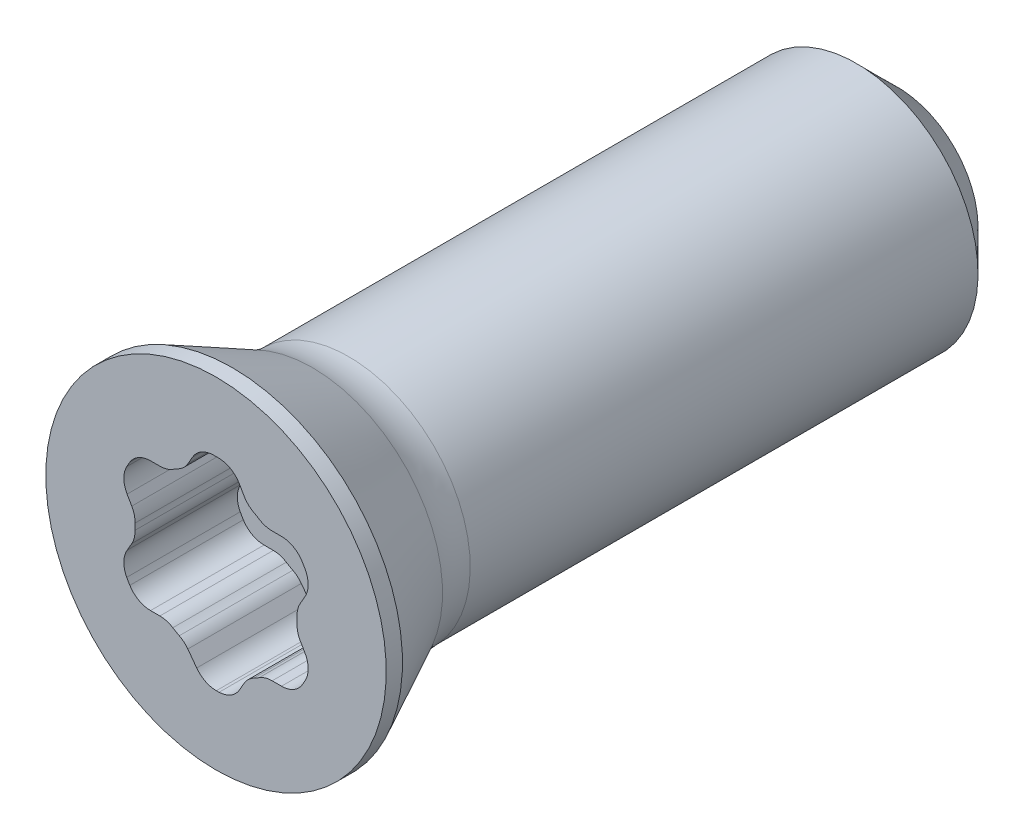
ISO-10303-21;
HEADER;
FILE_DESCRIPTION(('STEP AP214'),'2;1');
FILE_NAME('part.step','',(''),(''),'','','');
FILE_SCHEMA(('AUTOMOTIVE_DESIGN { 1 0 10303 214 1 1 1 1 }'));
ENDSEC;
DATA;
#1=APPLICATION_CONTEXT('core data for automotive mechanical design processes');
#2=APPLICATION_PROTOCOL_DEFINITION('international standard','automotive_design',2000,#1);
#3=PRODUCT_CONTEXT('',#1,'mechanical');
#4=PRODUCT('Part','Part','',(#3));
#5=PRODUCT_RELATED_PRODUCT_CATEGORY('part','',(#4));
#6=PRODUCT_DEFINITION_FORMATION('','',#4);
#7=PRODUCT_DEFINITION_CONTEXT('part definition',#1,'design');
#8=PRODUCT_DEFINITION('design','',#6,#7);
#9=PRODUCT_DEFINITION_SHAPE('','',#8);
#10=(LENGTH_UNIT() NAMED_UNIT(*) SI_UNIT(.MILLI.,.METRE.));
#11=(NAMED_UNIT(*) PLANE_ANGLE_UNIT() SI_UNIT($,.RADIAN.));
#12=(NAMED_UNIT(*) SI_UNIT($,.STERADIAN.) SOLID_ANGLE_UNIT());
#13=UNCERTAINTY_MEASURE_WITH_UNIT(LENGTH_MEASURE(1.E-05),#10,'distance_accuracy_value','');
#14=(GEOMETRIC_REPRESENTATION_CONTEXT(3) GLOBAL_UNCERTAINTY_ASSIGNED_CONTEXT((#13)) GLOBAL_UNIT_ASSIGNED_CONTEXT((#10,
#11,#12)) REPRESENTATION_CONTEXT('',''));
#15=CARTESIAN_POINT('',(0.,0.,0.));
#16=DIRECTION('',(0.,0.,1.));
#17=DIRECTION('',(1.,0.,0.));
#18=AXIS2_PLACEMENT_3D('',#15,#16,#17);
#19=CARTESIAN_POINT('',(0.,0.,-8.4));
#20=DIRECTION('',(0.,0.,1.));
#21=DIRECTION('',(0.,-1.,0.));
#22=AXIS2_PLACEMENT_3D('',#19,#20,#21);
#23=CYLINDRICAL_SURFACE('',#22,2.1);
#24=CARTESIAN_POINT('',(0.,0.,0.));
#25=DIRECTION('',(0.,0.,-1.));
#26=DIRECTION('',(0.,1.,0.));
#27=AXIS2_PLACEMENT_3D('',#24,#25,#26);
#28=CIRCLE('',#27,2.1);
#29=CARTESIAN_POINT('',(0.,2.1,0.));
#30=VERTEX_POINT('',#29);
#31=EDGE_CURVE('E687',#30,#30,#28,.F.);
#32=ORIENTED_EDGE('',*,*,#31,.F.);
#33=EDGE_LOOP('',(#32));
#34=FACE_BOUND('',#33,.T.);
#35=CARTESIAN_POINT('',(0.,0.,-0.20000000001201));
#36=DIRECTION('',(0.,0.,1.));
#37=DIRECTION('',(0.,-1.,0.));
#38=AXIS2_PLACEMENT_3D('',#35,#36,#37);
#39=CIRCLE('',#38,2.10000000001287);
#40=CARTESIAN_POINT('',(0.,-2.10000000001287,-0.20000000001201));
#41=VERTEX_POINT('',#40);
#42=EDGE_CURVE('E344',#41,#41,#39,.F.);
#43=ORIENTED_EDGE('',*,*,#42,.F.);
#44=EDGE_LOOP('',(#43));
#45=FACE_BOUND('',#44,.T.);
#46=ADVANCED_FACE('F14',(#34,#45),#23,.T.);
#47=CARTESIAN_POINT('',(0.,0.,-8.4));
#48=DIRECTION('',(0.,0.,1.));
#49=DIRECTION('',(0.,-1.,0.));
#50=AXIS2_PLACEMENT_3D('',#47,#48,#49);
#51=PLANE('',#50);
#52=CARTESIAN_POINT('',(0.,0.,-8.4));
#53=DIRECTION('',(0.,0.,1.));
#54=DIRECTION('',(0.,-1.,0.));
#55=AXIS2_PLACEMENT_3D('',#52,#53,#54);
#56=CIRCLE('',#55,0.999999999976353);
#57=CARTESIAN_POINT('',(0.,-0.999999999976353,-8.4));
#58=VERTEX_POINT('',#57);
#59=EDGE_CURVE('E340',#58,#58,#56,.T.);
#60=ORIENTED_EDGE('',*,*,#59,.F.);
#61=EDGE_LOOP('',(#60));
#62=FACE_BOUND('',#61,.T.);
#63=ADVANCED_FACE('F467',(#62),#51,.F.);
#64=CARTESIAN_POINT('',(0.,0.,-0.20000000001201));
#65=DIRECTION('',(0.,0.,1.));
#66=DIRECTION('',(0.,-1.,0.));
#67=AXIS2_PLACEMENT_3D('',#64,#65,#66);
#68=CONICAL_SURFACE('',#67,2.10000000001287,0.463647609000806);
#69=ORIENTED_EDGE('',*,*,#42,.T.);
#70=EDGE_LOOP('',(#69));
#71=FACE_BOUND('',#70,.T.);
#72=CARTESIAN_POINT('',(0.,0.,-1.18885438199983));
#73=DIRECTION('',(0.,0.,1.));
#74=DIRECTION('',(0.,-1.,0.));
#75=AXIS2_PLACEMENT_3D('',#72,#73,#74);
#76=CIRCLE('',#75,1.60557280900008);
#77=CARTESIAN_POINT('',(0.,-1.60557280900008,-1.18885438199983));
#78=VERTEX_POINT('',#77);
#79=EDGE_CURVE('E343',#78,#78,#76,.T.);
#80=ORIENTED_EDGE('',*,*,#79,.T.);
#81=EDGE_LOOP('',(#80));
#82=FACE_BOUND('',#81,.T.);
#83=ADVANCED_FACE('F463',(#71,#82),#68,.T.);
#84=CARTESIAN_POINT('',(0.,0.,-7.89999999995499));
#85=DIRECTION('',(0.,0.,1.));
#86=DIRECTION('',(0.,-1.,0.));
#87=AXIS2_PLACEMENT_3D('',#84,#85,#86);
#88=CONICAL_SURFACE('',#87,1.50000000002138,0.785398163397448);
#89=CARTESIAN_POINT('',(0.,0.,-7.9));
#90=DIRECTION('',(0.,0.,1.));
#91=DIRECTION('',(0.,-1.,0.));
#92=AXIS2_PLACEMENT_3D('',#89,#90,#91);
#93=CIRCLE('',#92,1.5);
#94=CARTESIAN_POINT('',(0.,-1.5,-7.9));
#95=VERTEX_POINT('',#94);
#96=EDGE_CURVE('E23',#95,#95,#93,.T.);
#97=ORIENTED_EDGE('',*,*,#96,.F.);
#98=EDGE_LOOP('',(#97));
#99=FACE_BOUND('',#98,.T.);
#100=ORIENTED_EDGE('',*,*,#59,.T.);
#101=EDGE_LOOP('',(#100));
#102=FACE_BOUND('',#101,.T.);
#103=ADVANCED_FACE('F458',(#99,#102),#88,.T.);
#104=CARTESIAN_POINT('',(0.,0.,-1.63606797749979));
#105=DIRECTION('',(0.,0.,1.));
#106=DIRECTION('',(0.,-1.,0.));
#107=AXIS2_PLACEMENT_3D('',#104,#105,#106);
#108=TOROIDAL_SURFACE('',#107,2.5,1.);
#109=ORIENTED_EDGE('',*,*,#79,.F.);
#110=EDGE_LOOP('',(#109));
#111=FACE_BOUND('',#110,.T.);
#112=CARTESIAN_POINT('',(0.,0.,-1.63606797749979));
#113=DIRECTION('',(0.,0.,1.));
#114=DIRECTION('',(0.,-1.,0.));
#115=AXIS2_PLACEMENT_3D('',#112,#113,#114);
#116=CIRCLE('',#115,1.5);
#117=CARTESIAN_POINT('',(0.,-1.5,-1.63606797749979));
#118=VERTEX_POINT('',#117);
#119=EDGE_CURVE('E9',#118,#118,#116,.F.);
#120=ORIENTED_EDGE('',*,*,#119,.F.);
#121=EDGE_LOOP('',(#120));
#122=FACE_BOUND('',#121,.T.);
#123=ADVANCED_FACE('F453',(#111,#122),#108,.F.);
#124=CARTESIAN_POINT('',(0.,0.,-8.4));
#125=DIRECTION('',(0.,0.,1.));
#126=DIRECTION('',(0.,-1.,0.));
#127=AXIS2_PLACEMENT_3D('',#124,#125,#126);
#128=CYLINDRICAL_SURFACE('',#127,1.5);
#129=ORIENTED_EDGE('',*,*,#119,.T.);
#130=EDGE_LOOP('',(#129));
#131=FACE_BOUND('',#130,.T.);
#132=ORIENTED_EDGE('',*,*,#96,.T.);
#133=EDGE_LOOP('',(#132));
#134=FACE_BOUND('',#133,.T.);
#135=ADVANCED_FACE('F457',(#131,#134),#128,.T.);
#136=CARTESIAN_POINT('',(0.,0.,0.));
#137=DIRECTION('',(0.,0.,-1.));
#138=DIRECTION('',(0.,1.,0.));
#139=AXIS2_PLACEMENT_3D('',#136,#137,#138);
#140=PLANE('',#139);
#141=ORIENTED_EDGE('',*,*,#31,.T.);
#142=EDGE_LOOP('',(#141));
#143=FACE_BOUND('',#142,.T.);
#144=CARTESIAN_POINT('',(1.29903810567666,-0.05,0.));
#145=DIRECTION('',(0.,0.,-1.));
#146=DIRECTION('',(0.,1.,0.));
#147=AXIS2_PLACEMENT_3D('',#144,#145,#146);
#148=CIRCLE('',#147,0.3);
#149=CARTESIAN_POINT('',(0.999260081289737,-0.038461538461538,0.));
#150=VERTEX_POINT('',#149);
#151=CARTESIAN_POINT('',(1.03923048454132,-0.199999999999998,0.));
#152=VERTEX_POINT('',#151);
#153=EDGE_CURVE('E691',#150,#152,#148,.F.);
#154=ORIENTED_EDGE('',*,*,#153,.T.);
#155=DIRECTION('',(-0.5,0.866025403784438,0.));
#156=VECTOR('',#155,1.);
#157=CARTESIAN_POINT('',(1.09670768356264,-0.29955342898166,0.));
#158=LINE('',#157,#156);
#159=CARTESIAN_POINT('',(1.09670768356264,-0.299553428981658,0.));
#160=VERTEX_POINT('',#159);
#161=EDGE_CURVE('E695',#160,#152,#158,.T.);
#162=ORIENTED_EDGE('',*,*,#161,.F.);
#163=CARTESIAN_POINT('',(0.836900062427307,-0.449553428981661,0.));
#164=DIRECTION('',(0.,0.,-1.));
#165=DIRECTION('',(0.,1.,0.));
#166=AXIS2_PLACEMENT_3D('',#163,#164,#165);
#167=CIRCLE('',#166,0.3);
#168=CARTESIAN_POINT('',(1.10118429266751,-0.591517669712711,0.));
#169=VERTEX_POINT('',#168);
#170=EDGE_CURVE('E942',#169,#160,#167,.F.);
#171=ORIENTED_EDGE('',*,*,#170,.F.);
#172=CARTESIAN_POINT('',(0.,0.,0.));
#173=DIRECTION('',(0.,0.,-1.));
#174=DIRECTION('',(0.,1.,0.));
#175=AXIS2_PLACEMENT_3D('',#172,#173,#174);
#176=CIRCLE('',#175,1.25);
#177=CARTESIAN_POINT('',(1.06286147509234,-0.657894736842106,0.));
#178=VERTEX_POINT('',#177);
#179=EDGE_CURVE('E936',#178,#169,#176,.F.);
#180=ORIENTED_EDGE('',*,*,#179,.F.);
#181=CARTESIAN_POINT('',(0.807774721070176,-0.5,0.));
#182=DIRECTION('',(0.,0.,-1.));
#183=DIRECTION('',(0.,1.,0.));
#184=AXIS2_PLACEMENT_3D('',#181,#182,#183);
#185=CIRCLE('',#184,0.3);
#186=CARTESIAN_POINT('',(0.807774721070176,-0.8,0.));
#187=VERTEX_POINT('',#186);
#188=EDGE_CURVE('E930',#187,#178,#185,.F.);
#189=ORIENTED_EDGE('',*,*,#188,.F.);
#190=DIRECTION('',(1.,0.,0.));
#191=VECTOR('',#190,1.);
#192=CARTESIAN_POINT('',(0.69282032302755,-0.8,0.));
#193=LINE('',#192,#191);
#194=CARTESIAN_POINT('',(0.69282032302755,-0.8,0.));
#195=VERTEX_POINT('',#194);
#196=EDGE_CURVE('E924',#195,#187,#193,.T.);
#197=ORIENTED_EDGE('',*,*,#196,.F.);
#198=CARTESIAN_POINT('',(0.69282032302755,-1.1,0.));
#199=DIRECTION('',(0.,0.,-1.));
#200=DIRECTION('',(0.,1.,0.));
#201=AXIS2_PLACEMENT_3D('',#198,#199,#200);
#202=CIRCLE('',#201,0.3);
#203=CARTESIAN_POINT('',(0.532938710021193,-0.846153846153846,0.));
#204=VERTEX_POINT('',#203);
#205=EDGE_CURVE('E919',#195,#204,#202,.F.);
#206=ORIENTED_EDGE('',*,*,#205,.T.);
#207=CARTESIAN_POINT('',(0.,0.,0.));
#208=DIRECTION('',(0.,0.,-1.));
#209=DIRECTION('',(0.,1.,0.));
#210=AXIS2_PLACEMENT_3D('',#207,#208,#209);
#211=CIRCLE('',#210,1.);
#212=CARTESIAN_POINT('',(0.466321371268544,-0.884615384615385,0.));
#213=VERTEX_POINT('',#212);
#214=EDGE_CURVE('E914',#213,#204,#211,.F.);
#215=ORIENTED_EDGE('',*,*,#214,.F.);
#216=CARTESIAN_POINT('',(0.606217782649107,-1.15,0.));
#217=DIRECTION('',(0.,0.,-1.));
#218=DIRECTION('',(0.,1.,0.));
#219=AXIS2_PLACEMENT_3D('',#216,#217,#218);
#220=CIRCLE('',#219,0.3);
#221=CARTESIAN_POINT('',(0.346410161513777,-1.,0.));
#222=VERTEX_POINT('',#221);
#223=EDGE_CURVE('E909',#213,#222,#220,.F.);
#224=ORIENTED_EDGE('',*,*,#223,.T.);
#225=DIRECTION('',(0.5,0.866025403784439,0.));
#226=VECTOR('',#225,1.);
#227=CARTESIAN_POINT('',(0.288932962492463,-1.09955342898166,0.));
#228=LINE('',#227,#226);
#229=CARTESIAN_POINT('',(0.288932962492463,-1.09955342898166,0.));
#230=VERTEX_POINT('',#229);
#231=EDGE_CURVE('E904',#230,#222,#228,.T.);
#232=ORIENTED_EDGE('',*,*,#231,.F.);
#233=CARTESIAN_POINT('',(0.0291253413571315,-0.949553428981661,0.));
#234=DIRECTION('',(0.,0.,-1.));
#235=DIRECTION('',(0.,1.,0.));
#236=AXIS2_PLACEMENT_3D('',#233,#234,#235);
#237=CIRCLE('',#236,0.3);
#238=CARTESIAN_POINT('',(0.0383228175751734,-1.24941240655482,0.));
#239=VERTEX_POINT('',#238);
#240=EDGE_CURVE('E893',#239,#230,#237,.F.);
#241=ORIENTED_EDGE('',*,*,#240,.F.);
#242=CARTESIAN_POINT('',(0.,0.,0.));
#243=DIRECTION('',(0.,0.,-1.));
#244=DIRECTION('',(0.,1.,0.));
#245=AXIS2_PLACEMENT_3D('',#242,#243,#244);
#246=CIRCLE('',#245,1.25);
#247=CARTESIAN_POINT('',(0.00381017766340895,-1.24999419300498,0.));
#248=VERTEX_POINT('',#247);
#249=EDGE_CURVE('E888',#248,#239,#246,.F.);
#250=ORIENTED_EDGE('',*,*,#249,.F.);
#251=CARTESIAN_POINT('',(0.00289573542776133,-0.949995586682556,0.));
#252=DIRECTION('',(0.,0.,-1.));
#253=DIRECTION('',(0.,1.,0.));
#254=AXIS2_PLACEMENT_3D('',#251,#252,#253);
#255=CIRCLE('',#254,0.3);
#256=CARTESIAN_POINT('',(-0.238241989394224,-1.12846854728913,0.));
#257=VERTEX_POINT('',#256);
#258=EDGE_CURVE('E1027',#257,#248,#255,.F.);
#259=ORIENTED_EDGE('',*,*,#258,.F.);
#260=DIRECTION('',(0.594909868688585,-0.803792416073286,0.));
#261=VECTOR('',#260,1.);
#262=CARTESIAN_POINT('',(-0.347766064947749,-0.980488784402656,0.));
#263=LINE('',#262,#261);
#264=CARTESIAN_POINT('',(-0.347766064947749,-0.980488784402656,0.));
#265=VERTEX_POINT('',#264);
#266=EDGE_CURVE('E1024',#265,#257,#263,.T.);
#267=ORIENTED_EDGE('',*,*,#266,.F.);
#268=CARTESIAN_POINT('',(-0.588903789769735,-1.15896174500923,0.));
#269=DIRECTION('',(0.,0.,-1.));
#270=DIRECTION('',(0.,1.,0.));
#271=AXIS2_PLACEMENT_3D('',#268,#269,#270);
#272=CIRCLE('',#271,0.3);
#273=CARTESIAN_POINT('',(-0.453002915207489,-0.891509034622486,0.));
#274=VERTEX_POINT('',#273);
#275=EDGE_CURVE('E875',#265,#274,#272,.F.);
#276=ORIENTED_EDGE('',*,*,#275,.T.);
#277=CARTESIAN_POINT('',(0.,0.,0.));
#278=DIRECTION('',(0.,0.,-1.));
#279=DIRECTION('',(0.,1.,0.));
#280=AXIS2_PLACEMENT_3D('',#277,#278,#279);
#281=CIRCLE('',#280,1.);
#282=CARTESIAN_POINT('',(-0.532938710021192,-0.846153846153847,0.));
#283=VERTEX_POINT('',#282);
#284=EDGE_CURVE('E1018',#283,#274,#281,.F.);
#285=ORIENTED_EDGE('',*,*,#284,.F.);
#286=CARTESIAN_POINT('',(-0.69282032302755,-1.1,0.));
#287=DIRECTION('',(0.,0.,-1.));
#288=DIRECTION('',(0.,1.,0.));
#289=AXIS2_PLACEMENT_3D('',#286,#287,#288);
#290=CIRCLE('',#289,0.3);
#291=CARTESIAN_POINT('',(-0.69282032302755,-0.8,0.));
#292=VERTEX_POINT('',#291);
#293=EDGE_CURVE('E868',#283,#292,#290,.F.);
#294=ORIENTED_EDGE('',*,*,#293,.T.);
#295=DIRECTION('',(1.,0.,0.));
#296=VECTOR('',#295,1.);
#297=CARTESIAN_POINT('',(-0.807774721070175,-0.8,0.));
#298=LINE('',#297,#296);
#299=CARTESIAN_POINT('',(-0.807774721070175,-0.8,0.));
#300=VERTEX_POINT('',#299);
#301=EDGE_CURVE('E863',#300,#292,#298,.T.);
#302=ORIENTED_EDGE('',*,*,#301,.F.);
#303=CARTESIAN_POINT('',(-0.807774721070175,-0.5,0.));
#304=DIRECTION('',(0.,0.,-1.));
#305=DIRECTION('',(0.,1.,0.));
#306=AXIS2_PLACEMENT_3D('',#303,#304,#305);
#307=CIRCLE('',#306,0.3);
#308=CARTESIAN_POINT('',(-1.06286147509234,-0.657894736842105,0.));
#309=VERTEX_POINT('',#308);
#310=EDGE_CURVE('E860',#309,#300,#307,.F.);
#311=ORIENTED_EDGE('',*,*,#310,.F.);
#312=CARTESIAN_POINT('',(0.,0.,0.));
#313=DIRECTION('',(0.,0.,-1.));
#314=DIRECTION('',(0.,1.,0.));
#315=AXIS2_PLACEMENT_3D('',#312,#313,#314);
#316=CIRCLE('',#315,1.25);
#317=CARTESIAN_POINT('',(-1.10118429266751,-0.591517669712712,0.));
#318=VERTEX_POINT('',#317);
#319=EDGE_CURVE('E855',#318,#309,#316,.F.);
#320=ORIENTED_EDGE('',*,*,#319,.F.);
#321=CARTESIAN_POINT('',(-0.836900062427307,-0.449553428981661,0.));
#322=DIRECTION('',(0.,0.,-1.));
#323=DIRECTION('',(0.,1.,0.));
#324=AXIS2_PLACEMENT_3D('',#321,#322,#323);
#325=CIRCLE('',#324,0.3);
#326=CARTESIAN_POINT('',(-1.09670768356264,-0.299553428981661,0.));
#327=VERTEX_POINT('',#326);
#328=EDGE_CURVE('E852',#327,#318,#325,.F.);
#329=ORIENTED_EDGE('',*,*,#328,.F.);
#330=DIRECTION('',(-0.5,-0.866025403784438,0.));
#331=VECTOR('',#330,1.);
#332=CARTESIAN_POINT('',(-1.03923048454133,-0.2,0.));
#333=LINE('',#332,#331);
#334=CARTESIAN_POINT('',(-1.03923048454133,-0.2,0.));
#335=VERTEX_POINT('',#334);
#336=EDGE_CURVE('E843',#335,#327,#333,.T.);
#337=ORIENTED_EDGE('',*,*,#336,.F.);
#338=CARTESIAN_POINT('',(-1.29903810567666,-0.05,0.));
#339=DIRECTION('',(0.,0.,-1.));
#340=DIRECTION('',(0.,1.,0.));
#341=AXIS2_PLACEMENT_3D('',#338,#339,#340);
#342=CIRCLE('',#341,0.3);
#343=CARTESIAN_POINT('',(-0.999260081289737,-0.0384615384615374,0.));
#344=VERTEX_POINT('',#343);
#345=EDGE_CURVE('E31',#335,#344,#342,.F.);
#346=ORIENTED_EDGE('',*,*,#345,.T.);
#347=CARTESIAN_POINT('',(0.,0.,0.));
#348=DIRECTION('',(0.,0.,-1.));
#349=DIRECTION('',(0.,1.,0.));
#350=AXIS2_PLACEMENT_3D('',#347,#348,#349);
#351=CIRCLE('',#350,1.);
#352=CARTESIAN_POINT('',(-0.999260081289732,0.0384615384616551,0.));
#353=VERTEX_POINT('',#352);
#354=EDGE_CURVE('E834',#353,#344,#351,.F.);
#355=ORIENTED_EDGE('',*,*,#354,.F.);
#356=CARTESIAN_POINT('',(-1.29903810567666,0.0499999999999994,0.));
#357=DIRECTION('',(0.,0.,-1.));
#358=DIRECTION('',(0.,1.,0.));
#359=AXIS2_PLACEMENT_3D('',#356,#357,#358);
#360=CIRCLE('',#359,0.3);
#361=CARTESIAN_POINT('',(-1.03923048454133,0.2,0.));
#362=VERTEX_POINT('',#361);
#363=EDGE_CURVE('E836',#353,#362,#360,.F.);
#364=ORIENTED_EDGE('',*,*,#363,.T.);
#365=DIRECTION('',(0.5,-0.866025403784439,0.));
#366=VECTOR('',#365,1.);
#367=CARTESIAN_POINT('',(-1.09670768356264,0.299553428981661,0.));
#368=LINE('',#367,#366);
#369=CARTESIAN_POINT('',(-1.09670768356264,0.299553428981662,0.));
#370=VERTEX_POINT('',#369);
#371=EDGE_CURVE('E1003',#370,#362,#368,.T.);
#372=ORIENTED_EDGE('',*,*,#371,.F.);
#373=CARTESIAN_POINT('',(-0.836900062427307,0.449553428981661,0.));
#374=DIRECTION('',(0.,0.,-1.));
#375=DIRECTION('',(0.,1.,0.));
#376=AXIS2_PLACEMENT_3D('',#373,#374,#375);
#377=CIRCLE('',#376,0.3);
#378=CARTESIAN_POINT('',(-1.10118429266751,0.591517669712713,0.));
#379=VERTEX_POINT('',#378);
#380=EDGE_CURVE('E1000',#379,#370,#377,.F.);
#381=ORIENTED_EDGE('',*,*,#380,.F.);
#382=CARTESIAN_POINT('',(0.,0.,0.));
#383=DIRECTION('',(0.,0.,-1.));
#384=DIRECTION('',(0.,1.,0.));
#385=AXIS2_PLACEMENT_3D('',#382,#383,#384);
#386=CIRCLE('',#385,1.25);
#387=CARTESIAN_POINT('',(-1.06286147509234,0.657894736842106,0.));
#388=VERTEX_POINT('',#387);
#389=EDGE_CURVE('E998',#388,#379,#386,.F.);
#390=ORIENTED_EDGE('',*,*,#389,.F.);
#391=CARTESIAN_POINT('',(-0.807774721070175,0.5,0.));
#392=DIRECTION('',(0.,0.,-1.));
#393=DIRECTION('',(0.,1.,0.));
#394=AXIS2_PLACEMENT_3D('',#391,#392,#393);
#395=CIRCLE('',#394,0.3);
#396=CARTESIAN_POINT('',(-0.807774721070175,0.8,0.));
#397=VERTEX_POINT('',#396);
#398=EDGE_CURVE('E992',#397,#388,#395,.F.);
#399=ORIENTED_EDGE('',*,*,#398,.F.);
#400=DIRECTION('',(-1.,0.,0.));
#401=VECTOR('',#400,1.);
#402=CARTESIAN_POINT('',(-0.69282032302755,0.8,0.));
#403=LINE('',#402,#401);
#404=CARTESIAN_POINT('',(-0.69282032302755,0.8,0.));
#405=VERTEX_POINT('',#404);
#406=EDGE_CURVE('E990',#405,#397,#403,.T.);
#407=ORIENTED_EDGE('',*,*,#406,.F.);
#408=CARTESIAN_POINT('',(-0.69282032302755,1.1,0.));
#409=DIRECTION('',(0.,0.,-1.));
#410=DIRECTION('',(0.,1.,0.));
#411=AXIS2_PLACEMENT_3D('',#408,#409,#410);
#412=CIRCLE('',#411,0.3);
#413=CARTESIAN_POINT('',(-0.532938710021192,0.846153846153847,0.));
#414=VERTEX_POINT('',#413);
#415=EDGE_CURVE('E1016',#405,#414,#412,.F.);
#416=ORIENTED_EDGE('',*,*,#415,.T.);
#417=CARTESIAN_POINT('',(0.,0.,0.));
#418=DIRECTION('',(0.,0.,-1.));
#419=DIRECTION('',(0.,1.,0.));
#420=AXIS2_PLACEMENT_3D('',#417,#418,#419);
#421=CIRCLE('',#420,1.);
#422=CARTESIAN_POINT('',(-0.466321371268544,0.884615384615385,0.));
#423=VERTEX_POINT('',#422);
#424=EDGE_CURVE('E983',#423,#414,#421,.F.);
#425=ORIENTED_EDGE('',*,*,#424,.F.);
#426=CARTESIAN_POINT('',(-0.606217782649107,1.15,0.));
#427=DIRECTION('',(0.,0.,-1.));
#428=DIRECTION('',(0.,1.,0.));
#429=AXIS2_PLACEMENT_3D('',#426,#427,#428);
#430=CIRCLE('',#429,0.3);
#431=CARTESIAN_POINT('',(-0.346410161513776,1.,0.));
#432=VERTEX_POINT('',#431);
#433=EDGE_CURVE('E1022',#423,#432,#430,.F.);
#434=ORIENTED_EDGE('',*,*,#433,.T.);
#435=DIRECTION('',(-0.5,-0.866025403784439,0.));
#436=VECTOR('',#435,1.);
#437=CARTESIAN_POINT('',(-0.288932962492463,1.09955342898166,0.));
#438=LINE('',#437,#436);
#439=CARTESIAN_POINT('',(-0.288932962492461,1.09955342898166,0.));
#440=VERTEX_POINT('',#439);
#441=EDGE_CURVE('E976',#440,#432,#438,.T.);
#442=ORIENTED_EDGE('',*,*,#441,.F.);
#443=CARTESIAN_POINT('',(-0.0291253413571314,0.949553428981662,0.));
#444=DIRECTION('',(0.,0.,-1.));
#445=DIRECTION('',(0.,1.,0.));
#446=AXIS2_PLACEMENT_3D('',#443,#444,#445);
#447=CIRCLE('',#446,0.3);
#448=CARTESIAN_POINT('',(-0.0383228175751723,1.24941240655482,0.));
#449=VERTEX_POINT('',#448);
#450=EDGE_CURVE('E896',#449,#440,#447,.F.);
#451=ORIENTED_EDGE('',*,*,#450,.F.);
#452=CARTESIAN_POINT('',(0.,0.,0.));
#453=DIRECTION('',(0.,0.,-1.));
#454=DIRECTION('',(0.,1.,0.));
#455=AXIS2_PLACEMENT_3D('',#452,#453,#454);
#456=CIRCLE('',#455,1.25);
#457=CARTESIAN_POINT('',(0.0383228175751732,1.24941240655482,0.));
#458=VERTEX_POINT('',#457);
#459=EDGE_CURVE('E890',#458,#449,#456,.F.);
#460=ORIENTED_EDGE('',*,*,#459,.F.);
#461=CARTESIAN_POINT('',(0.0291253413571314,0.949553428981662,0.));
#462=DIRECTION('',(0.,0.,-1.));
#463=DIRECTION('',(0.,1.,0.));
#464=AXIS2_PLACEMENT_3D('',#461,#462,#463);
#465=CIRCLE('',#464,0.3);
#466=CARTESIAN_POINT('',(0.288932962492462,1.09955342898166,0.));
#467=VERTEX_POINT('',#466);
#468=EDGE_CURVE('E889',#467,#458,#465,.F.);
#469=ORIENTED_EDGE('',*,*,#468,.F.);
#470=DIRECTION('',(-0.5,0.866025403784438,0.));
#471=VECTOR('',#470,1.);
#472=CARTESIAN_POINT('',(0.346410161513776,1.,0.));
#473=LINE('',#472,#471);
#474=CARTESIAN_POINT('',(0.346410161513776,1.,0.));
#475=VERTEX_POINT('',#474);
#476=EDGE_CURVE('E901',#475,#467,#473,.T.);
#477=ORIENTED_EDGE('',*,*,#476,.F.);
#478=CARTESIAN_POINT('',(0.606217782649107,1.15,0.));
#479=DIRECTION('',(0.,0.,-1.));
#480=DIRECTION('',(0.,1.,0.));
#481=AXIS2_PLACEMENT_3D('',#478,#479,#480);
#482=CIRCLE('',#481,0.3);
#483=CARTESIAN_POINT('',(0.466321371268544,0.884615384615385,0.));
#484=VERTEX_POINT('',#483);
#485=EDGE_CURVE('E907',#475,#484,#482,.F.);
#486=ORIENTED_EDGE('',*,*,#485,.T.);
#487=CARTESIAN_POINT('',(0.,0.,0.));
#488=DIRECTION('',(0.,0.,-1.));
#489=DIRECTION('',(0.,1.,0.));
#490=AXIS2_PLACEMENT_3D('',#487,#488,#489);
#491=CIRCLE('',#490,1.);
#492=CARTESIAN_POINT('',(0.532938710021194,0.846153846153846,0.));
#493=VERTEX_POINT('',#492);
#494=EDGE_CURVE('E911',#493,#484,#491,.F.);
#495=ORIENTED_EDGE('',*,*,#494,.F.);
#496=CARTESIAN_POINT('',(0.692820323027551,1.1,0.));
#497=DIRECTION('',(0.,0.,-1.));
#498=DIRECTION('',(0.,1.,0.));
#499=AXIS2_PLACEMENT_3D('',#496,#497,#498);
#500=CIRCLE('',#499,0.3);
#501=CARTESIAN_POINT('',(0.692820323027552,0.8,0.));
#502=VERTEX_POINT('',#501);
#503=EDGE_CURVE('E917',#493,#502,#500,.F.);
#504=ORIENTED_EDGE('',*,*,#503,.T.);
#505=DIRECTION('',(-1.,0.,0.));
#506=VECTOR('',#505,1.);
#507=CARTESIAN_POINT('',(0.807774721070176,0.8,0.));
#508=LINE('',#507,#506);
#509=CARTESIAN_POINT('',(0.807774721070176,0.8,0.));
#510=VERTEX_POINT('',#509);
#511=EDGE_CURVE('E921',#510,#502,#508,.T.);
#512=ORIENTED_EDGE('',*,*,#511,.F.);
#513=CARTESIAN_POINT('',(0.807774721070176,0.5,0.));
#514=DIRECTION('',(0.,0.,-1.));
#515=DIRECTION('',(0.,1.,0.));
#516=AXIS2_PLACEMENT_3D('',#513,#514,#515);
#517=CIRCLE('',#516,0.3);
#518=CARTESIAN_POINT('',(1.06286147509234,0.657894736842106,0.));
#519=VERTEX_POINT('',#518);
#520=EDGE_CURVE('E927',#519,#510,#517,.F.);
#521=ORIENTED_EDGE('',*,*,#520,.F.);
#522=CARTESIAN_POINT('',(0.,0.,0.));
#523=DIRECTION('',(0.,0.,-1.));
#524=DIRECTION('',(0.,1.,0.));
#525=AXIS2_PLACEMENT_3D('',#522,#523,#524);
#526=CIRCLE('',#525,1.25);
#527=CARTESIAN_POINT('',(1.10118429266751,0.591517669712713,0.));
#528=VERTEX_POINT('',#527);
#529=EDGE_CURVE('E933',#528,#519,#526,.F.);
#530=ORIENTED_EDGE('',*,*,#529,.F.);
#531=CARTESIAN_POINT('',(0.836900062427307,0.449553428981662,0.));
#532=DIRECTION('',(0.,0.,-1.));
#533=DIRECTION('',(0.,1.,0.));
#534=AXIS2_PLACEMENT_3D('',#531,#532,#533);
#535=CIRCLE('',#534,0.3);
#536=CARTESIAN_POINT('',(1.09670768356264,0.299553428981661,0.));
#537=VERTEX_POINT('',#536);
#538=EDGE_CURVE('E939',#537,#528,#535,.F.);
#539=ORIENTED_EDGE('',*,*,#538,.F.);
#540=DIRECTION('',(0.5,0.866025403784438,0.));
#541=VECTOR('',#540,1.);
#542=CARTESIAN_POINT('',(1.03923048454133,0.2,0.));
#543=LINE('',#542,#541);
#544=CARTESIAN_POINT('',(1.03923048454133,0.2,0.));
#545=VERTEX_POINT('',#544);
#546=EDGE_CURVE('E705',#545,#537,#543,.T.);
#547=ORIENTED_EDGE('',*,*,#546,.F.);
#548=CARTESIAN_POINT('',(1.29903810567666,0.05,0.));
#549=DIRECTION('',(0.,0.,-1.));
#550=DIRECTION('',(0.,1.,0.));
#551=AXIS2_PLACEMENT_3D('',#548,#549,#550);
#552=CIRCLE('',#551,0.3);
#553=CARTESIAN_POINT('',(0.999260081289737,0.0384615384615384,0.));
#554=VERTEX_POINT('',#553);
#555=EDGE_CURVE('E700',#545,#554,#552,.F.);
#556=ORIENTED_EDGE('',*,*,#555,.T.);
#557=CARTESIAN_POINT('',(0.,0.,0.));
#558=DIRECTION('',(0.,0.,-1.));
#559=DIRECTION('',(0.,1.,0.));
#560=AXIS2_PLACEMENT_3D('',#557,#558,#559);
#561=CIRCLE('',#560,1.);
#562=EDGE_CURVE('E199',#150,#554,#561,.F.);
#563=ORIENTED_EDGE('',*,*,#562,.F.);
#564=EDGE_LOOP('',(#154,#162,#171,#180,#189,#197,#206,#215,#224,#232,#241,#250,#259,#267,#276,
#285,#294,#302,#311,#320,#329,#337,#346,#355,#364,#372,#381,#390,#399,#407,#416,#425,#434,#442,
#451,#460,#469,#477,#486,#495,#504,#512,#521,#530,#539,#547,#556,#563));
#565=FACE_BOUND('',#564,.T.);
#566=ADVANCED_FACE('F475',(#143,#565),#140,.F.);
#567=CARTESIAN_POINT('',(-0.69282032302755,-1.1,-1.4));
#568=DIRECTION('',(0.,0.,1.));
#569=DIRECTION('',(0.,-1.,0.));
#570=AXIS2_PLACEMENT_3D('',#567,#568,#569);
#571=PLANE('',#570);
#572=CARTESIAN_POINT('',(-0.807774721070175,-0.5,-1.4));
#573=DIRECTION('',(0.,0.,1.));
#574=DIRECTION('',(0.,-1.,0.));
#575=AXIS2_PLACEMENT_3D('',#572,#573,#574);
#576=CIRCLE('',#575,0.3);
#577=CARTESIAN_POINT('',(-1.06286147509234,-0.657894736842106,-1.4));
#578=VERTEX_POINT('',#577);
#579=CARTESIAN_POINT('',(-0.807774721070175,-0.8,-1.4));
#580=VERTEX_POINT('',#579);
#581=EDGE_CURVE('E312',#578,#580,#576,.T.);
#582=ORIENTED_EDGE('',*,*,#581,.T.);
#583=DIRECTION('',(1.,0.,0.));
#584=VECTOR('',#583,1.);
#585=CARTESIAN_POINT('',(-0.807774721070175,-0.8,-1.4));
#586=LINE('',#585,#584);
#587=CARTESIAN_POINT('',(-0.69282032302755,-0.8,-1.4));
#588=VERTEX_POINT('',#587);
#589=EDGE_CURVE('E417',#580,#588,#586,.T.);
#590=ORIENTED_EDGE('',*,*,#589,.T.);
#591=CARTESIAN_POINT('',(-0.69282032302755,-1.1,-1.4));
#592=DIRECTION('',(0.,0.,1.));
#593=DIRECTION('',(0.,-1.,0.));
#594=AXIS2_PLACEMENT_3D('',#591,#592,#593);
#595=CIRCLE('',#594,0.3);
#596=CARTESIAN_POINT('',(-0.532938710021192,-0.846153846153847,-1.4));
#597=VERTEX_POINT('',#596);
#598=EDGE_CURVE('E304',#597,#588,#595,.T.);
#599=ORIENTED_EDGE('',*,*,#598,.F.);
#600=CARTESIAN_POINT('',(0.,0.,-1.4));
#601=DIRECTION('',(0.,0.,1.));
#602=DIRECTION('',(0.,-1.,0.));
#603=AXIS2_PLACEMENT_3D('',#600,#601,#602);
#604=CIRCLE('',#603,1.);
#605=CARTESIAN_POINT('',(-0.453002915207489,-0.891509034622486,-1.4));
#606=VERTEX_POINT('',#605);
#607=EDGE_CURVE('E297',#597,#606,#604,.T.);
#608=ORIENTED_EDGE('',*,*,#607,.T.);
#609=CARTESIAN_POINT('',(-0.588903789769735,-1.15896174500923,-1.4));
#610=DIRECTION('',(0.,0.,1.));
#611=DIRECTION('',(0.,-1.,0.));
#612=AXIS2_PLACEMENT_3D('',#609,#610,#611);
#613=CIRCLE('',#612,0.3);
#614=CARTESIAN_POINT('',(-0.347766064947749,-0.980488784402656,-1.4));
#615=VERTEX_POINT('',#614);
#616=EDGE_CURVE('E290',#615,#606,#613,.T.);
#617=ORIENTED_EDGE('',*,*,#616,.F.);
#618=DIRECTION('',(0.594909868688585,-0.803792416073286,0.));
#619=VECTOR('',#618,1.);
#620=CARTESIAN_POINT('',(-0.347766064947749,-0.980488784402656,-1.4));
#621=LINE('',#620,#619);
#622=CARTESIAN_POINT('',(-0.238241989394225,-1.12846854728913,-1.4));
#623=VERTEX_POINT('',#622);
#624=EDGE_CURVE('E400',#615,#623,#621,.T.);
#625=ORIENTED_EDGE('',*,*,#624,.T.);
#626=CARTESIAN_POINT('',(0.00289573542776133,-0.949995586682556,-1.4));
#627=DIRECTION('',(0.,0.,1.));
#628=DIRECTION('',(0.,-1.,0.));
#629=AXIS2_PLACEMENT_3D('',#626,#627,#628);
#630=CIRCLE('',#629,0.3);
#631=CARTESIAN_POINT('',(0.00289573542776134,-1.24999558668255,-1.4));
#632=VERTEX_POINT('',#631);
#633=EDGE_CURVE('E282',#623,#632,#630,.T.);
#634=ORIENTED_EDGE('',*,*,#633,.T.);
#635=DIRECTION('',(1.,0.,0.));
#636=VECTOR('',#635,1.);
#637=CARTESIAN_POINT('',(-0.69282032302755,-1.24999558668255,-1.4));
#638=LINE('',#637,#636);
#639=CARTESIAN_POINT('',(0.00381017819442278,-1.24999454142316,-1.4));
#640=VERTEX_POINT('',#639);
#641=EDGE_CURVE('E275',#632,#640,#638,.T.);
#642=ORIENTED_EDGE('',*,*,#641,.T.);
#643=CARTESIAN_POINT('',(0.,0.,-1.4));
#644=DIRECTION('',(0.,0.,1.));
#645=DIRECTION('',(0.,-1.,0.));
#646=AXIS2_PLACEMENT_3D('',#643,#644,#645);
#647=CIRCLE('',#646,1.25);
#648=CARTESIAN_POINT('',(0.0383228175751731,-1.24941240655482,-1.4));
#649=VERTEX_POINT('',#648);
#650=EDGE_CURVE('E266',#640,#649,#647,.T.);
#651=ORIENTED_EDGE('',*,*,#650,.T.);
#652=CARTESIAN_POINT('',(0.0291253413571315,-0.949553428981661,-1.4));
#653=DIRECTION('',(0.,0.,1.));
#654=DIRECTION('',(0.,-1.,0.));
#655=AXIS2_PLACEMENT_3D('',#652,#653,#654);
#656=CIRCLE('',#655,0.3);
#657=CARTESIAN_POINT('',(0.288932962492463,-1.09955342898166,-1.4));
#658=VERTEX_POINT('',#657);
#659=EDGE_CURVE('E259',#649,#658,#656,.T.);
#660=ORIENTED_EDGE('',*,*,#659,.T.);
#661=DIRECTION('',(0.5,0.866025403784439,0.));
#662=VECTOR('',#661,1.);
#663=CARTESIAN_POINT('',(0.288932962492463,-1.09955342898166,-1.4));
#664=LINE('',#663,#662);
#665=CARTESIAN_POINT('',(0.346410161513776,-1.,-1.4));
#666=VERTEX_POINT('',#665);
#667=EDGE_CURVE('E378',#658,#666,#664,.T.);
#668=ORIENTED_EDGE('',*,*,#667,.T.);
#669=CARTESIAN_POINT('',(0.606217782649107,-1.15,-1.4));
#670=DIRECTION('',(0.,0.,1.));
#671=DIRECTION('',(0.,-1.,0.));
#672=AXIS2_PLACEMENT_3D('',#669,#670,#671);
#673=CIRCLE('',#672,0.3);
#674=CARTESIAN_POINT('',(0.466321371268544,-0.884615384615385,-1.4));
#675=VERTEX_POINT('',#674);
#676=EDGE_CURVE('E252',#675,#666,#673,.T.);
#677=ORIENTED_EDGE('',*,*,#676,.F.);
#678=CARTESIAN_POINT('',(0.,0.,-1.4));
#679=DIRECTION('',(0.,0.,1.));
#680=DIRECTION('',(0.,-1.,0.));
#681=AXIS2_PLACEMENT_3D('',#678,#679,#680);
#682=CIRCLE('',#681,1.);
#683=CARTESIAN_POINT('',(0.532938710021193,-0.846153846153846,-1.4));
#684=VERTEX_POINT('',#683);
#685=EDGE_CURVE('E245',#675,#684,#682,.T.);
#686=ORIENTED_EDGE('',*,*,#685,.T.);
#687=CARTESIAN_POINT('',(0.69282032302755,-1.1,-1.4));
#688=DIRECTION('',(0.,0.,1.));
#689=DIRECTION('',(0.,-1.,0.));
#690=AXIS2_PLACEMENT_3D('',#687,#688,#689);
#691=CIRCLE('',#690,0.3);
#692=CARTESIAN_POINT('',(0.69282032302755,-0.8,-1.4));
#693=VERTEX_POINT('',#692);
#694=EDGE_CURVE('E237',#693,#684,#691,.T.);
#695=ORIENTED_EDGE('',*,*,#694,.F.);
#696=DIRECTION('',(1.,0.,0.));
#697=VECTOR('',#696,1.);
#698=CARTESIAN_POINT('',(0.69282032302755,-0.8,-1.4));
#699=LINE('',#698,#697);
#700=CARTESIAN_POINT('',(0.807774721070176,-0.8,-1.4));
#701=VERTEX_POINT('',#700);
#702=EDGE_CURVE('E235',#693,#701,#699,.T.);
#703=ORIENTED_EDGE('',*,*,#702,.T.);
#704=CARTESIAN_POINT('',(0.807774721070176,-0.5,-1.4));
#705=DIRECTION('',(0.,0.,1.));
#706=DIRECTION('',(0.,-1.,0.));
#707=AXIS2_PLACEMENT_3D('',#704,#705,#706);
#708=CIRCLE('',#707,0.3);
#709=CARTESIAN_POINT('',(1.06286147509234,-0.657894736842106,-1.4));
#710=VERTEX_POINT('',#709);
#711=EDGE_CURVE('E228',#701,#710,#708,.T.);
#712=ORIENTED_EDGE('',*,*,#711,.T.);
#713=CARTESIAN_POINT('',(0.,0.,-1.4));
#714=DIRECTION('',(0.,0.,1.));
#715=DIRECTION('',(0.,-1.,0.));
#716=AXIS2_PLACEMENT_3D('',#713,#714,#715);
#717=CIRCLE('',#716,1.25);
#718=CARTESIAN_POINT('',(1.10118429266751,-0.591517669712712,-1.4));
#719=VERTEX_POINT('',#718);
#720=EDGE_CURVE('E221',#710,#719,#717,.T.);
#721=ORIENTED_EDGE('',*,*,#720,.T.);
#722=CARTESIAN_POINT('',(0.836900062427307,-0.449553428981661,-1.4));
#723=DIRECTION('',(0.,0.,1.));
#724=DIRECTION('',(0.,-1.,0.));
#725=AXIS2_PLACEMENT_3D('',#722,#723,#724);
#726=CIRCLE('',#725,0.3);
#727=CARTESIAN_POINT('',(1.09670768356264,-0.29955342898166,-1.4));
#728=VERTEX_POINT('',#727);
#729=EDGE_CURVE('E214',#719,#728,#726,.T.);
#730=ORIENTED_EDGE('',*,*,#729,.T.);
#731=DIRECTION('',(-0.5,0.866025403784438,0.));
#732=VECTOR('',#731,1.);
#733=CARTESIAN_POINT('',(1.09670768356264,-0.29955342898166,-1.4));
#734=LINE('',#733,#732);
#735=CARTESIAN_POINT('',(1.03923048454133,-0.2,-1.4));
#736=VERTEX_POINT('',#735);
#737=EDGE_CURVE('E207',#728,#736,#734,.T.);
#738=ORIENTED_EDGE('',*,*,#737,.T.);
#739=CARTESIAN_POINT('',(1.29903810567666,-0.05,-1.4));
#740=DIRECTION('',(0.,0.,1.));
#741=DIRECTION('',(0.,-1.,0.));
#742=AXIS2_PLACEMENT_3D('',#739,#740,#741);
#743=CIRCLE('',#742,0.3);
#744=CARTESIAN_POINT('',(0.999260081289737,-0.038461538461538,-1.4));
#745=VERTEX_POINT('',#744);
#746=EDGE_CURVE('E195',#745,#736,#743,.T.);
#747=ORIENTED_EDGE('',*,*,#746,.F.);
#748=CARTESIAN_POINT('',(0.,0.,-1.4));
#749=DIRECTION('',(0.,0.,1.));
#750=DIRECTION('',(0.,-1.,0.));
#751=AXIS2_PLACEMENT_3D('',#748,#749,#750);
#752=CIRCLE('',#751,1.);
#753=CARTESIAN_POINT('',(0.999260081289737,0.0384615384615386,-1.4));
#754=VERTEX_POINT('',#753);
#755=EDGE_CURVE('E18',#745,#754,#752,.T.);
#756=ORIENTED_EDGE('',*,*,#755,.T.);
#757=CARTESIAN_POINT('',(1.29903810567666,0.05,-1.4));
#758=DIRECTION('',(0.,0.,1.));
#759=DIRECTION('',(0.,-1.,0.));
#760=AXIS2_PLACEMENT_3D('',#757,#758,#759);
#761=CIRCLE('',#760,0.3);
#762=CARTESIAN_POINT('',(1.03923048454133,0.2,-1.4));
#763=VERTEX_POINT('',#762);
#764=EDGE_CURVE('E192',#763,#754,#761,.T.);
#765=ORIENTED_EDGE('',*,*,#764,.F.);
#766=DIRECTION('',(0.5,0.866025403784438,0.));
#767=VECTOR('',#766,1.);
#768=CARTESIAN_POINT('',(1.03923048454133,0.2,-1.4));
#769=LINE('',#768,#767);
#770=CARTESIAN_POINT('',(1.09670768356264,0.299553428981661,-1.4));
#771=VERTEX_POINT('',#770);
#772=EDGE_CURVE('E217',#763,#771,#769,.T.);
#773=ORIENTED_EDGE('',*,*,#772,.T.);
#774=CARTESIAN_POINT('',(0.836900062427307,0.449553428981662,-1.4));
#775=DIRECTION('',(0.,0.,1.));
#776=DIRECTION('',(0.,-1.,0.));
#777=AXIS2_PLACEMENT_3D('',#774,#775,#776);
#778=CIRCLE('',#777,0.3);
#779=CARTESIAN_POINT('',(1.10118429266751,0.591517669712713,-1.4));
#780=VERTEX_POINT('',#779);
#781=EDGE_CURVE('E218',#771,#780,#778,.T.);
#782=ORIENTED_EDGE('',*,*,#781,.T.);
#783=CARTESIAN_POINT('',(0.,0.,-1.4));
#784=DIRECTION('',(0.,0.,1.));
#785=DIRECTION('',(0.,-1.,0.));
#786=AXIS2_PLACEMENT_3D('',#783,#784,#785);
#787=CIRCLE('',#786,1.25);
#788=CARTESIAN_POINT('',(1.06286147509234,0.657894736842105,-1.4));
#789=VERTEX_POINT('',#788);
#790=EDGE_CURVE('E225',#780,#789,#787,.T.);
#791=ORIENTED_EDGE('',*,*,#790,.T.);
#792=CARTESIAN_POINT('',(0.807774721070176,0.5,-1.4));
#793=DIRECTION('',(0.,0.,1.));
#794=DIRECTION('',(0.,-1.,0.));
#795=AXIS2_PLACEMENT_3D('',#792,#793,#794);
#796=CIRCLE('',#795,0.3);
#797=CARTESIAN_POINT('',(0.807774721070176,0.8,-1.4));
#798=VERTEX_POINT('',#797);
#799=EDGE_CURVE('E232',#789,#798,#796,.T.);
#800=ORIENTED_EDGE('',*,*,#799,.T.);
#801=DIRECTION('',(-1.,0.,0.));
#802=VECTOR('',#801,1.);
#803=CARTESIAN_POINT('',(0.807774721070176,0.8,-1.4));
#804=LINE('',#803,#802);
#805=CARTESIAN_POINT('',(0.692820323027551,0.8,-1.4));
#806=VERTEX_POINT('',#805);
#807=EDGE_CURVE('E366',#798,#806,#804,.T.);
#808=ORIENTED_EDGE('',*,*,#807,.T.);
#809=CARTESIAN_POINT('',(0.692820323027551,1.1,-1.4));
#810=DIRECTION('',(0.,0.,1.));
#811=DIRECTION('',(0.,-1.,0.));
#812=AXIS2_PLACEMENT_3D('',#809,#810,#811);
#813=CIRCLE('',#812,0.3);
#814=CARTESIAN_POINT('',(0.532938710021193,0.846153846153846,-1.4));
#815=VERTEX_POINT('',#814);
#816=EDGE_CURVE('E240',#815,#806,#813,.T.);
#817=ORIENTED_EDGE('',*,*,#816,.F.);
#818=CARTESIAN_POINT('',(0.,0.,-1.4));
#819=DIRECTION('',(0.,0.,1.));
#820=DIRECTION('',(0.,-1.,0.));
#821=AXIS2_PLACEMENT_3D('',#818,#819,#820);
#822=CIRCLE('',#821,1.);
#823=CARTESIAN_POINT('',(0.466321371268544,0.884615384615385,-1.4));
#824=VERTEX_POINT('',#823);
#825=EDGE_CURVE('E248',#815,#824,#822,.T.);
#826=ORIENTED_EDGE('',*,*,#825,.T.);
#827=CARTESIAN_POINT('',(0.606217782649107,1.15,-1.4));
#828=DIRECTION('',(0.,0.,1.));
#829=DIRECTION('',(0.,-1.,0.));
#830=AXIS2_PLACEMENT_3D('',#827,#828,#829);
#831=CIRCLE('',#830,0.3);
#832=CARTESIAN_POINT('',(0.346410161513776,1.,-1.4));
#833=VERTEX_POINT('',#832);
#834=EDGE_CURVE('E255',#833,#824,#831,.T.);
#835=ORIENTED_EDGE('',*,*,#834,.F.);
#836=DIRECTION('',(-0.5,0.866025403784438,0.));
#837=VECTOR('',#836,1.);
#838=CARTESIAN_POINT('',(0.346410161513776,1.,-1.4));
#839=LINE('',#838,#837);
#840=CARTESIAN_POINT('',(0.288932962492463,1.09955342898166,-1.4));
#841=VERTEX_POINT('',#840);
#842=EDGE_CURVE('E262',#833,#841,#839,.T.);
#843=ORIENTED_EDGE('',*,*,#842,.T.);
#844=CARTESIAN_POINT('',(0.0291253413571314,0.949553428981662,-1.4));
#845=DIRECTION('',(0.,0.,1.));
#846=DIRECTION('',(0.,-1.,0.));
#847=AXIS2_PLACEMENT_3D('',#844,#845,#846);
#848=CIRCLE('',#847,0.3);
#849=CARTESIAN_POINT('',(0.0383228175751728,1.24941240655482,-1.4));
#850=VERTEX_POINT('',#849);
#851=EDGE_CURVE('E263',#841,#850,#848,.T.);
#852=ORIENTED_EDGE('',*,*,#851,.T.);
#853=CARTESIAN_POINT('',(0.,0.,-1.4));
#854=DIRECTION('',(0.,0.,1.));
#855=DIRECTION('',(0.,-1.,0.));
#856=AXIS2_PLACEMENT_3D('',#853,#854,#855);
#857=CIRCLE('',#856,1.25);
#858=CARTESIAN_POINT('',(-0.0383228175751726,1.24941240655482,-1.4));
#859=VERTEX_POINT('',#858);
#860=EDGE_CURVE('E270',#850,#859,#857,.T.);
#861=ORIENTED_EDGE('',*,*,#860,.T.);
#862=CARTESIAN_POINT('',(-0.0291253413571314,0.949553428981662,-1.4));
#863=DIRECTION('',(0.,0.,1.));
#864=DIRECTION('',(0.,-1.,0.));
#865=AXIS2_PLACEMENT_3D('',#862,#863,#864);
#866=CIRCLE('',#865,0.3);
#867=CARTESIAN_POINT('',(-0.288932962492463,1.09955342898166,-1.4));
#868=VERTEX_POINT('',#867);
#869=EDGE_CURVE('E279',#859,#868,#866,.T.);
#870=ORIENTED_EDGE('',*,*,#869,.T.);
#871=DIRECTION('',(-0.5,-0.866025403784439,0.));
#872=VECTOR('',#871,1.);
#873=CARTESIAN_POINT('',(-0.288932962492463,1.09955342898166,-1.4));
#874=LINE('',#873,#872);
#875=CARTESIAN_POINT('',(-0.346410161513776,1.,-1.4));
#876=VERTEX_POINT('',#875);
#877=EDGE_CURVE('E397',#868,#876,#874,.T.);
#878=ORIENTED_EDGE('',*,*,#877,.T.);
#879=CARTESIAN_POINT('',(-0.606217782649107,1.15,-1.4));
#880=DIRECTION('',(0.,0.,1.));
#881=DIRECTION('',(0.,-1.,0.));
#882=AXIS2_PLACEMENT_3D('',#879,#880,#881);
#883=CIRCLE('',#882,0.3);
#884=CARTESIAN_POINT('',(-0.466321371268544,0.884615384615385,-1.4));
#885=VERTEX_POINT('',#884);
#886=EDGE_CURVE('E285',#885,#876,#883,.T.);
#887=ORIENTED_EDGE('',*,*,#886,.F.);
#888=CARTESIAN_POINT('',(0.,0.,-1.4));
#889=DIRECTION('',(0.,0.,1.));
#890=DIRECTION('',(0.,-1.,0.));
#891=AXIS2_PLACEMENT_3D('',#888,#889,#890);
#892=CIRCLE('',#891,1.);
#893=CARTESIAN_POINT('',(-0.532938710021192,0.846153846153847,-1.4));
#894=VERTEX_POINT('',#893);
#895=EDGE_CURVE('E295',#885,#894,#892,.T.);
#896=ORIENTED_EDGE('',*,*,#895,.T.);
#897=CARTESIAN_POINT('',(-0.69282032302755,1.1,-1.4));
#898=DIRECTION('',(0.,0.,1.));
#899=DIRECTION('',(0.,-1.,0.));
#900=AXIS2_PLACEMENT_3D('',#897,#898,#899);
#901=CIRCLE('',#900,0.3);
#902=CARTESIAN_POINT('',(-0.69282032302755,0.8,-1.4));
#903=VERTEX_POINT('',#902);
#904=EDGE_CURVE('E300',#903,#894,#901,.T.);
#905=ORIENTED_EDGE('',*,*,#904,.F.);
#906=DIRECTION('',(-1.,0.,0.));
#907=VECTOR('',#906,1.);
#908=CARTESIAN_POINT('',(-0.69282032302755,0.8,-1.4));
#909=LINE('',#908,#907);
#910=CARTESIAN_POINT('',(-0.807774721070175,0.8,-1.4));
#911=VERTEX_POINT('',#910);
#912=EDGE_CURVE('E413',#903,#911,#909,.T.);
#913=ORIENTED_EDGE('',*,*,#912,.T.);
#914=CARTESIAN_POINT('',(-0.807774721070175,0.5,-1.4));
#915=DIRECTION('',(0.,0.,1.));
#916=DIRECTION('',(0.,-1.,0.));
#917=AXIS2_PLACEMENT_3D('',#914,#915,#916);
#918=CIRCLE('',#917,0.3);
#919=CARTESIAN_POINT('',(-1.06286147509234,0.657894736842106,-1.4));
#920=VERTEX_POINT('',#919);
#921=EDGE_CURVE('E309',#911,#920,#918,.T.);
#922=ORIENTED_EDGE('',*,*,#921,.T.);
#923=CARTESIAN_POINT('',(0.,0.,-1.4));
#924=DIRECTION('',(0.,0.,1.));
#925=DIRECTION('',(0.,-1.,0.));
#926=AXIS2_PLACEMENT_3D('',#923,#924,#925);
#927=CIRCLE('',#926,1.25);
#928=CARTESIAN_POINT('',(-1.10118429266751,0.591517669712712,-1.4));
#929=VERTEX_POINT('',#928);
#930=EDGE_CURVE('E316',#920,#929,#927,.T.);
#931=ORIENTED_EDGE('',*,*,#930,.T.);
#932=CARTESIAN_POINT('',(-0.836900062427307,0.449553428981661,-1.4));
#933=DIRECTION('',(0.,0.,1.));
#934=DIRECTION('',(0.,-1.,0.));
#935=AXIS2_PLACEMENT_3D('',#932,#933,#934);
#936=CIRCLE('',#935,0.3);
#937=CARTESIAN_POINT('',(-1.09670768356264,0.299553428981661,-1.4));
#938=VERTEX_POINT('',#937);
#939=EDGE_CURVE('E323',#929,#938,#936,.T.);
#940=ORIENTED_EDGE('',*,*,#939,.T.);
#941=DIRECTION('',(0.5,-0.866025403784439,0.));
#942=VECTOR('',#941,1.);
#943=CARTESIAN_POINT('',(-1.09670768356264,0.299553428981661,-1.4));
#944=LINE('',#943,#942);
#945=CARTESIAN_POINT('',(-1.03923048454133,0.2,-1.4));
#946=VERTEX_POINT('',#945);
#947=EDGE_CURVE('E430',#938,#946,#944,.T.);
#948=ORIENTED_EDGE('',*,*,#947,.T.);
#949=CARTESIAN_POINT('',(-1.29903810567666,0.0499999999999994,-1.4));
#950=DIRECTION('',(0.,0.,1.));
#951=DIRECTION('',(0.,-1.,0.));
#952=AXIS2_PLACEMENT_3D('',#949,#950,#951);
#953=CIRCLE('',#952,0.3);
#954=CARTESIAN_POINT('',(-0.999260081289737,0.0384615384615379,-1.4));
#955=VERTEX_POINT('',#954);
#956=EDGE_CURVE('E330',#946,#955,#953,.F.);
#957=ORIENTED_EDGE('',*,*,#956,.T.);
#958=CARTESIAN_POINT('',(0.,0.,-1.4));
#959=DIRECTION('',(0.,0.,1.));
#960=DIRECTION('',(0.,-1.,0.));
#961=AXIS2_PLACEMENT_3D('',#958,#959,#960);
#962=CIRCLE('',#961,1.);
#963=CARTESIAN_POINT('',(-0.999260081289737,-0.0384615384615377,-1.4));
#964=VERTEX_POINT('',#963);
#965=EDGE_CURVE('E40',#955,#964,#962,.T.);
#966=ORIENTED_EDGE('',*,*,#965,.T.);
#967=CARTESIAN_POINT('',(-1.29903810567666,-0.05,-1.4));
#968=DIRECTION('',(0.,0.,1.));
#969=DIRECTION('',(0.,-1.,0.));
#970=AXIS2_PLACEMENT_3D('',#967,#968,#969);
#971=CIRCLE('',#970,0.3);
#972=CARTESIAN_POINT('',(-1.03923048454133,-0.2,-1.4));
#973=VERTEX_POINT('',#972);
#974=EDGE_CURVE('E334',#973,#964,#971,.T.);
#975=ORIENTED_EDGE('',*,*,#974,.F.);
#976=DIRECTION('',(-0.5,-0.866025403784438,0.));
#977=VECTOR('',#976,1.);
#978=CARTESIAN_POINT('',(-1.03923048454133,-0.2,-1.4));
#979=LINE('',#978,#977);
#980=CARTESIAN_POINT('',(-1.09670768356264,-0.299553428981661,-1.4));
#981=VERTEX_POINT('',#980);
#982=EDGE_CURVE('E332',#973,#981,#979,.T.);
#983=ORIENTED_EDGE('',*,*,#982,.T.);
#984=CARTESIAN_POINT('',(-0.836900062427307,-0.449553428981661,-1.4));
#985=DIRECTION('',(0.,0.,1.));
#986=DIRECTION('',(0.,-1.,0.));
#987=AXIS2_PLACEMENT_3D('',#984,#985,#986);
#988=CIRCLE('',#987,0.3);
#989=CARTESIAN_POINT('',(-1.10118429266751,-0.591517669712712,-1.4));
#990=VERTEX_POINT('',#989);
#991=EDGE_CURVE('E326',#981,#990,#988,.T.);
#992=ORIENTED_EDGE('',*,*,#991,.T.);
#993=CARTESIAN_POINT('',(0.,0.,-1.4));
#994=DIRECTION('',(0.,0.,1.));
#995=DIRECTION('',(0.,-1.,0.));
#996=AXIS2_PLACEMENT_3D('',#993,#994,#995);
#997=CIRCLE('',#996,1.25);
#998=EDGE_CURVE('E319',#990,#578,#997,.T.);
#999=ORIENTED_EDGE('',*,*,#998,.T.);
#1000=EDGE_LOOP('',(#582,#590,#599,#608,#617,#625,#634,#642,#651,#660,#668,#677,#686,#695,#703,
#712,#721,#730,#738,#747,#756,#765,#773,#782,#791,#800,#808,#817,#826,#835,#843,#852,#861,#870,
#878,#887,#896,#905,#913,#922,#931,#940,#948,#957,#966,#975,#983,#992,#999));
#1001=FACE_BOUND('',#1000,.T.);
#1002=ADVANCED_FACE('F189',(#1001),#571,.T.);
#1003=CARTESIAN_POINT('',(0.,0.,-1.4));
#1004=DIRECTION('',(0.,0.,1.));
#1005=DIRECTION('',(0.,-1.,0.));
#1006=AXIS2_PLACEMENT_3D('',#1003,#1004,#1005);
#1007=CYLINDRICAL_SURFACE('',#1006,1.);
#1008=DIRECTION('',(0.,0.,1.));
#1009=VECTOR('',#1008,1.);
#1010=CARTESIAN_POINT('',(-0.999260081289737,0.0384615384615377,-1.4));
#1011=LINE('',#1010,#1009);
#1012=EDGE_CURVE('E336',#353,#955,#1011,.F.);
#1013=ORIENTED_EDGE('',*,*,#1012,.F.);
#1014=ORIENTED_EDGE('',*,*,#354,.T.);
#1015=DIRECTION('',(0.,0.,1.));
#1016=VECTOR('',#1015,1.);
#1017=CARTESIAN_POINT('',(-0.999260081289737,-0.0384615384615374,-1.4));
#1018=LINE('',#1017,#1016);
#1019=EDGE_CURVE('E339',#964,#344,#1018,.T.);
#1020=ORIENTED_EDGE('',*,*,#1019,.F.);
#1021=ORIENTED_EDGE('',*,*,#965,.F.);
#1022=EDGE_LOOP('',(#1013,#1014,#1020,#1021));
#1023=FACE_BOUND('',#1022,.T.);
#1024=ADVANCED_FACE('F476',(#1023),#1007,.F.);
#1025=CARTESIAN_POINT('',(-1.29903810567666,-0.05,-1.4));
#1026=DIRECTION('',(0.,0.,1.));
#1027=DIRECTION('',(0.,-1.,0.));
#1028=AXIS2_PLACEMENT_3D('',#1025,#1026,#1027);
#1029=CYLINDRICAL_SURFACE('',#1028,0.3);
#1030=ORIENTED_EDGE('',*,*,#345,.F.);
#1031=DIRECTION('',(0.,0.,1.));
#1032=VECTOR('',#1031,1.);
#1033=CARTESIAN_POINT('',(-1.03923048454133,-0.2,-1.4));
#1034=LINE('',#1033,#1032);
#1035=EDGE_CURVE('E337',#335,#973,#1034,.F.);
#1036=ORIENTED_EDGE('',*,*,#1035,.T.);
#1037=ORIENTED_EDGE('',*,*,#974,.T.);
#1038=ORIENTED_EDGE('',*,*,#1019,.T.);
#1039=EDGE_LOOP('',(#1030,#1036,#1037,#1038));
#1040=FACE_BOUND('',#1039,.T.);
#1041=ADVANCED_FACE('F479',(#1040),#1029,.T.);
#1042=CARTESIAN_POINT('',(-1.29903810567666,0.0499999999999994,-1.4));
#1043=DIRECTION('',(0.,0.,1.));
#1044=DIRECTION('',(0.,-1.,0.));
#1045=AXIS2_PLACEMENT_3D('',#1042,#1043,#1044);
#1046=CYLINDRICAL_SURFACE('',#1045,0.3);
#1047=ORIENTED_EDGE('',*,*,#363,.F.);
#1048=ORIENTED_EDGE('',*,*,#1012,.T.);
#1049=ORIENTED_EDGE('',*,*,#956,.F.);
#1050=DIRECTION('',(0.,0.,1.));
#1051=VECTOR('',#1050,1.);
#1052=CARTESIAN_POINT('',(-1.03923048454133,0.2,-1.4));
#1053=LINE('',#1052,#1051);
#1054=EDGE_CURVE('E333',#946,#362,#1053,.T.);
#1055=ORIENTED_EDGE('',*,*,#1054,.T.);
#1056=EDGE_LOOP('',(#1047,#1048,#1049,#1055));
#1057=FACE_BOUND('',#1056,.T.);
#1058=ADVANCED_FACE('F483',(#1057),#1046,.T.);
#1059=CARTESIAN_POINT('',(-1.03923048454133,-0.2,-1.4));
#1060=DIRECTION('',(-0.866025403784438,0.5,0.));
#1061=DIRECTION('',(-0.5,-0.866025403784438,0.));
#1062=AXIS2_PLACEMENT_3D('',#1059,#1060,#1061);
#1063=PLANE('',#1062);
#1064=ORIENTED_EDGE('',*,*,#1035,.F.);
#1065=ORIENTED_EDGE('',*,*,#336,.T.);
#1066=DIRECTION('',(0.,0.,1.));
#1067=VECTOR('',#1066,1.);
#1068=CARTESIAN_POINT('',(-1.09670768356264,-0.299553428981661,-1.4));
#1069=LINE('',#1068,#1067);
#1070=EDGE_CURVE('E434',#981,#327,#1069,.T.);
#1071=ORIENTED_EDGE('',*,*,#1070,.F.);
#1072=ORIENTED_EDGE('',*,*,#982,.F.);
#1073=EDGE_LOOP('',(#1064,#1065,#1071,#1072));
#1074=FACE_BOUND('',#1073,.T.);
#1075=ADVANCED_FACE('F489',(#1074),#1063,.F.);
#1076=CARTESIAN_POINT('',(-1.09670768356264,0.299553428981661,-1.4));
#1077=DIRECTION('',(-0.866025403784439,-0.5,0.));
#1078=DIRECTION('',(0.5,-0.866025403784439,0.));
#1079=AXIS2_PLACEMENT_3D('',#1076,#1077,#1078);
#1080=PLANE('',#1079);
#1081=DIRECTION('',(0.,0.,1.));
#1082=VECTOR('',#1081,1.);
#1083=CARTESIAN_POINT('',(-1.09670768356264,0.299553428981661,-1.4));
#1084=LINE('',#1083,#1082);
#1085=EDGE_CURVE('E428',#370,#938,#1084,.F.);
#1086=ORIENTED_EDGE('',*,*,#1085,.F.);
#1087=ORIENTED_EDGE('',*,*,#371,.T.);
#1088=ORIENTED_EDGE('',*,*,#1054,.F.);
#1089=ORIENTED_EDGE('',*,*,#947,.F.);
#1090=EDGE_LOOP('',(#1086,#1087,#1088,#1089));
#1091=FACE_BOUND('',#1090,.T.);
#1092=ADVANCED_FACE('F493',(#1091),#1080,.F.);
#1093=CARTESIAN_POINT('',(-0.836900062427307,-0.449553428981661,-1.4));
#1094=DIRECTION('',(0.,0.,1.));
#1095=DIRECTION('',(0.,-1.,0.));
#1096=AXIS2_PLACEMENT_3D('',#1093,#1094,#1095);
#1097=CYLINDRICAL_SURFACE('',#1096,0.3);
#1098=ORIENTED_EDGE('',*,*,#1070,.T.);
#1099=ORIENTED_EDGE('',*,*,#328,.T.);
#1100=DIRECTION('',(0.,0.,1.));
#1101=VECTOR('',#1100,1.);
#1102=CARTESIAN_POINT('',(-1.10118429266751,-0.591517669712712,-1.4));
#1103=LINE('',#1102,#1101);
#1104=EDGE_CURVE('E329',#990,#318,#1103,.T.);
#1105=ORIENTED_EDGE('',*,*,#1104,.F.);
#1106=ORIENTED_EDGE('',*,*,#991,.F.);
#1107=EDGE_LOOP('',(#1098,#1099,#1105,#1106));
#1108=FACE_BOUND('',#1107,.T.);
#1109=ADVANCED_FACE('F497',(#1108),#1097,.F.);
#1110=CARTESIAN_POINT('',(-0.836900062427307,0.449553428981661,-1.4));
#1111=DIRECTION('',(0.,0.,1.));
#1112=DIRECTION('',(0.,-1.,0.));
#1113=AXIS2_PLACEMENT_3D('',#1110,#1111,#1112);
#1114=CYLINDRICAL_SURFACE('',#1113,0.3);
#1115=DIRECTION('',(0.,0.,1.));
#1116=VECTOR('',#1115,1.);
#1117=CARTESIAN_POINT('',(-1.10118429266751,0.591517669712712,-1.4));
#1118=LINE('',#1117,#1116);
#1119=EDGE_CURVE('E327',#379,#929,#1118,.F.);
#1120=ORIENTED_EDGE('',*,*,#1119,.F.);
#1121=ORIENTED_EDGE('',*,*,#380,.T.);
#1122=ORIENTED_EDGE('',*,*,#1085,.T.);
#1123=ORIENTED_EDGE('',*,*,#939,.F.);
#1124=EDGE_LOOP('',(#1120,#1121,#1122,#1123));
#1125=FACE_BOUND('',#1124,.T.);
#1126=ADVANCED_FACE('F501',(#1125),#1114,.F.);
#1127=CARTESIAN_POINT('',(0.,0.,-1.4));
#1128=DIRECTION('',(0.,0.,1.));
#1129=DIRECTION('',(0.,-1.,0.));
#1130=AXIS2_PLACEMENT_3D('',#1127,#1128,#1129);
#1131=CYLINDRICAL_SURFACE('',#1130,1.25);
#1132=ORIENTED_EDGE('',*,*,#1104,.T.);
#1133=ORIENTED_EDGE('',*,*,#319,.T.);
#1134=DIRECTION('',(0.,0.,1.));
#1135=VECTOR('',#1134,1.);
#1136=CARTESIAN_POINT('',(-1.06286147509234,-0.657894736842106,-1.4));
#1137=LINE('',#1136,#1135);
#1138=EDGE_CURVE('E322',#578,#309,#1137,.T.);
#1139=ORIENTED_EDGE('',*,*,#1138,.F.);
#1140=ORIENTED_EDGE('',*,*,#998,.F.);
#1141=EDGE_LOOP('',(#1132,#1133,#1139,#1140));
#1142=FACE_BOUND('',#1141,.T.);
#1143=ADVANCED_FACE('F505',(#1142),#1131,.F.);
#1144=CARTESIAN_POINT('',(0.,0.,-1.4));
#1145=DIRECTION('',(0.,0.,1.));
#1146=DIRECTION('',(0.,-1.,0.));
#1147=AXIS2_PLACEMENT_3D('',#1144,#1145,#1146);
#1148=CYLINDRICAL_SURFACE('',#1147,1.25);
#1149=DIRECTION('',(0.,0.,1.));
#1150=VECTOR('',#1149,1.);
#1151=CARTESIAN_POINT('',(-1.06286147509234,0.657894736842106,-1.4));
#1152=LINE('',#1151,#1150);
#1153=EDGE_CURVE('E320',#388,#920,#1152,.F.);
#1154=ORIENTED_EDGE('',*,*,#1153,.F.);
#1155=ORIENTED_EDGE('',*,*,#389,.T.);
#1156=ORIENTED_EDGE('',*,*,#1119,.T.);
#1157=ORIENTED_EDGE('',*,*,#930,.F.);
#1158=EDGE_LOOP('',(#1154,#1155,#1156,#1157));
#1159=FACE_BOUND('',#1158,.T.);
#1160=ADVANCED_FACE('F509',(#1159),#1148,.F.);
#1161=CARTESIAN_POINT('',(-0.807774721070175,-0.5,-1.4));
#1162=DIRECTION('',(0.,0.,1.));
#1163=DIRECTION('',(0.,-1.,0.));
#1164=AXIS2_PLACEMENT_3D('',#1161,#1162,#1163);
#1165=CYLINDRICAL_SURFACE('',#1164,0.3);
#1166=ORIENTED_EDGE('',*,*,#1138,.T.);
#1167=ORIENTED_EDGE('',*,*,#310,.T.);
#1168=DIRECTION('',(0.,0.,1.));
#1169=VECTOR('',#1168,1.);
#1170=CARTESIAN_POINT('',(-0.807774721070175,-0.8,-1.4));
#1171=LINE('',#1170,#1169);
#1172=EDGE_CURVE('E315',#580,#300,#1171,.T.);
#1173=ORIENTED_EDGE('',*,*,#1172,.F.);
#1174=ORIENTED_EDGE('',*,*,#581,.F.);
#1175=EDGE_LOOP('',(#1166,#1167,#1173,#1174));
#1176=FACE_BOUND('',#1175,.T.);
#1177=ADVANCED_FACE('F513',(#1176),#1165,.F.);
#1178=CARTESIAN_POINT('',(-0.807774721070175,0.5,-1.4));
#1179=DIRECTION('',(0.,0.,1.));
#1180=DIRECTION('',(0.,-1.,0.));
#1181=AXIS2_PLACEMENT_3D('',#1178,#1179,#1180);
#1182=CYLINDRICAL_SURFACE('',#1181,0.3);
#1183=DIRECTION('',(0.,0.,1.));
#1184=VECTOR('',#1183,1.);
#1185=CARTESIAN_POINT('',(-0.807774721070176,0.8,-1.4));
#1186=LINE('',#1185,#1184);
#1187=EDGE_CURVE('E313',#397,#911,#1186,.F.);
#1188=ORIENTED_EDGE('',*,*,#1187,.F.);
#1189=ORIENTED_EDGE('',*,*,#398,.T.);
#1190=ORIENTED_EDGE('',*,*,#1153,.T.);
#1191=ORIENTED_EDGE('',*,*,#921,.F.);
#1192=EDGE_LOOP('',(#1188,#1189,#1190,#1191));
#1193=FACE_BOUND('',#1192,.T.);
#1194=ADVANCED_FACE('F517',(#1193),#1182,.F.);
#1195=CARTESIAN_POINT('',(-0.807774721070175,-0.8,-1.4));
#1196=DIRECTION('',(0.,-1.,0.));
#1197=DIRECTION('',(1.,0.,0.));
#1198=AXIS2_PLACEMENT_3D('',#1195,#1196,#1197);
#1199=PLANE('',#1198);
#1200=ORIENTED_EDGE('',*,*,#1172,.T.);
#1201=ORIENTED_EDGE('',*,*,#301,.T.);
#1202=DIRECTION('',(0.,0.,1.));
#1203=VECTOR('',#1202,1.);
#1204=CARTESIAN_POINT('',(-0.69282032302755,-0.8,-1.4));
#1205=LINE('',#1204,#1203);
#1206=EDGE_CURVE('E414',#588,#292,#1205,.T.);
#1207=ORIENTED_EDGE('',*,*,#1206,.F.);
#1208=ORIENTED_EDGE('',*,*,#589,.F.);
#1209=EDGE_LOOP('',(#1200,#1201,#1207,#1208));
#1210=FACE_BOUND('',#1209,.T.);
#1211=ADVANCED_FACE('F521',(#1210),#1199,.F.);
#1212=CARTESIAN_POINT('',(-0.69282032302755,0.8,-1.4));
#1213=DIRECTION('',(0.,1.,0.));
#1214=DIRECTION('',(-1.,0.,0.));
#1215=AXIS2_PLACEMENT_3D('',#1212,#1213,#1214);
#1216=PLANE('',#1215);
#1217=DIRECTION('',(0.,0.,1.));
#1218=VECTOR('',#1217,1.);
#1219=CARTESIAN_POINT('',(-0.69282032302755,0.8,-1.4));
#1220=LINE('',#1219,#1218);
#1221=EDGE_CURVE('E307',#405,#903,#1220,.F.);
#1222=ORIENTED_EDGE('',*,*,#1221,.F.);
#1223=ORIENTED_EDGE('',*,*,#406,.T.);
#1224=ORIENTED_EDGE('',*,*,#1187,.T.);
#1225=ORIENTED_EDGE('',*,*,#912,.F.);
#1226=EDGE_LOOP('',(#1222,#1223,#1224,#1225));
#1227=FACE_BOUND('',#1226,.T.);
#1228=ADVANCED_FACE('F525',(#1227),#1216,.F.);
#1229=CARTESIAN_POINT('',(-0.69282032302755,-1.1,-1.4));
#1230=DIRECTION('',(0.,0.,1.));
#1231=DIRECTION('',(0.,-1.,0.));
#1232=AXIS2_PLACEMENT_3D('',#1229,#1230,#1231);
#1233=CYLINDRICAL_SURFACE('',#1232,0.3);
#1234=ORIENTED_EDGE('',*,*,#293,.F.);
#1235=DIRECTION('',(0.,0.,1.));
#1236=VECTOR('',#1235,1.);
#1237=CARTESIAN_POINT('',(-0.532938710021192,-0.846153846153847,-1.4));
#1238=LINE('',#1237,#1236);
#1239=EDGE_CURVE('E308',#283,#597,#1238,.F.);
#1240=ORIENTED_EDGE('',*,*,#1239,.T.);
#1241=ORIENTED_EDGE('',*,*,#598,.T.);
#1242=ORIENTED_EDGE('',*,*,#1206,.T.);
#1243=EDGE_LOOP('',(#1234,#1240,#1241,#1242));
#1244=FACE_BOUND('',#1243,.T.);
#1245=ADVANCED_FACE('F529',(#1244),#1233,.T.);
#1246=CARTESIAN_POINT('',(-0.69282032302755,1.1,-1.4));
#1247=DIRECTION('',(0.,0.,1.));
#1248=DIRECTION('',(0.,-1.,0.));
#1249=AXIS2_PLACEMENT_3D('',#1246,#1247,#1248);
#1250=CYLINDRICAL_SURFACE('',#1249,0.3);
#1251=ORIENTED_EDGE('',*,*,#415,.F.);
#1252=ORIENTED_EDGE('',*,*,#1221,.T.);
#1253=ORIENTED_EDGE('',*,*,#904,.T.);
#1254=DIRECTION('',(0.,0.,1.));
#1255=VECTOR('',#1254,1.);
#1256=CARTESIAN_POINT('',(-0.532938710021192,0.846153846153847,-1.4));
#1257=LINE('',#1256,#1255);
#1258=EDGE_CURVE('E303',#894,#414,#1257,.T.);
#1259=ORIENTED_EDGE('',*,*,#1258,.T.);
#1260=EDGE_LOOP('',(#1251,#1252,#1253,#1259));
#1261=FACE_BOUND('',#1260,.T.);
#1262=ADVANCED_FACE('F533',(#1261),#1250,.T.);
#1263=CARTESIAN_POINT('',(0.,0.,-1.4));
#1264=DIRECTION('',(0.,0.,1.));
#1265=DIRECTION('',(0.,-1.,0.));
#1266=AXIS2_PLACEMENT_3D('',#1263,#1264,#1265);
#1267=CYLINDRICAL_SURFACE('',#1266,1.);
#1268=ORIENTED_EDGE('',*,*,#1239,.F.);
#1269=ORIENTED_EDGE('',*,*,#284,.T.);
#1270=DIRECTION('',(0.,0.,1.));
#1271=VECTOR('',#1270,1.);
#1272=CARTESIAN_POINT('',(-0.453002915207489,-0.891509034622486,-1.4));
#1273=LINE('',#1272,#1271);
#1274=EDGE_CURVE('E299',#606,#274,#1273,.T.);
#1275=ORIENTED_EDGE('',*,*,#1274,.F.);
#1276=ORIENTED_EDGE('',*,*,#607,.F.);
#1277=EDGE_LOOP('',(#1268,#1269,#1275,#1276));
#1278=FACE_BOUND('',#1277,.T.);
#1279=ADVANCED_FACE('F537',(#1278),#1267,.F.);
#1280=CARTESIAN_POINT('',(0.,0.,-1.4));
#1281=DIRECTION('',(0.,0.,1.));
#1282=DIRECTION('',(0.,-1.,0.));
#1283=AXIS2_PLACEMENT_3D('',#1280,#1281,#1282);
#1284=CYLINDRICAL_SURFACE('',#1283,1.);
#1285=DIRECTION('',(0.,0.,1.));
#1286=VECTOR('',#1285,1.);
#1287=CARTESIAN_POINT('',(-0.466321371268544,0.884615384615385,-1.4));
#1288=LINE('',#1287,#1286);
#1289=EDGE_CURVE('E293',#423,#885,#1288,.F.);
#1290=ORIENTED_EDGE('',*,*,#1289,.F.);
#1291=ORIENTED_EDGE('',*,*,#424,.T.);
#1292=ORIENTED_EDGE('',*,*,#1258,.F.);
#1293=ORIENTED_EDGE('',*,*,#895,.F.);
#1294=EDGE_LOOP('',(#1290,#1291,#1292,#1293));
#1295=FACE_BOUND('',#1294,.T.);
#1296=ADVANCED_FACE('F541',(#1295),#1284,.F.);
#1297=CARTESIAN_POINT('',(-0.588903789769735,-1.15896174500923,-1.4));
#1298=DIRECTION('',(0.,0.,1.));
#1299=DIRECTION('',(0.,-1.,0.));
#1300=AXIS2_PLACEMENT_3D('',#1297,#1298,#1299);
#1301=CYLINDRICAL_SURFACE('',#1300,0.3);
#1302=ORIENTED_EDGE('',*,*,#275,.F.);
#1303=DIRECTION('',(0.,0.,1.));
#1304=VECTOR('',#1303,1.);
#1305=CARTESIAN_POINT('',(-0.347766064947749,-0.980488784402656,-1.4));
#1306=LINE('',#1305,#1304);
#1307=EDGE_CURVE('E294',#265,#615,#1306,.F.);
#1308=ORIENTED_EDGE('',*,*,#1307,.T.);
#1309=ORIENTED_EDGE('',*,*,#616,.T.);
#1310=ORIENTED_EDGE('',*,*,#1274,.T.);
#1311=EDGE_LOOP('',(#1302,#1308,#1309,#1310));
#1312=FACE_BOUND('',#1311,.T.);
#1313=ADVANCED_FACE('F545',(#1312),#1301,.T.);
#1314=CARTESIAN_POINT('',(-0.606217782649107,1.15,-1.4));
#1315=DIRECTION('',(0.,0.,1.));
#1316=DIRECTION('',(0.,-1.,0.));
#1317=AXIS2_PLACEMENT_3D('',#1314,#1315,#1316);
#1318=CYLINDRICAL_SURFACE('',#1317,0.3);
#1319=ORIENTED_EDGE('',*,*,#433,.F.);
#1320=ORIENTED_EDGE('',*,*,#1289,.T.);
#1321=ORIENTED_EDGE('',*,*,#886,.T.);
#1322=DIRECTION('',(0.,0.,1.));
#1323=VECTOR('',#1322,1.);
#1324=CARTESIAN_POINT('',(-0.346410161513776,1.,-1.4));
#1325=LINE('',#1324,#1323);
#1326=EDGE_CURVE('E288',#876,#432,#1325,.T.);
#1327=ORIENTED_EDGE('',*,*,#1326,.T.);
#1328=EDGE_LOOP('',(#1319,#1320,#1321,#1327));
#1329=FACE_BOUND('',#1328,.T.);
#1330=ADVANCED_FACE('F549',(#1329),#1318,.T.);
#1331=CARTESIAN_POINT('',(-0.347766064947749,-0.980488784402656,-1.4));
#1332=DIRECTION('',(-0.803792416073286,-0.594909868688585,0.));
#1333=DIRECTION('',(0.594909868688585,-0.803792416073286,0.));
#1334=AXIS2_PLACEMENT_3D('',#1331,#1332,#1333);
#1335=PLANE('',#1334);
#1336=ORIENTED_EDGE('',*,*,#1307,.F.);
#1337=ORIENTED_EDGE('',*,*,#266,.T.);
#1338=DIRECTION('',(0.,0.,1.));
#1339=VECTOR('',#1338,1.);
#1340=CARTESIAN_POINT('',(-0.238241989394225,-1.12846854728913,-1.4));
#1341=LINE('',#1340,#1339);
#1342=EDGE_CURVE('E289',#623,#257,#1341,.T.);
#1343=ORIENTED_EDGE('',*,*,#1342,.F.);
#1344=ORIENTED_EDGE('',*,*,#624,.F.);
#1345=EDGE_LOOP('',(#1336,#1337,#1343,#1344));
#1346=FACE_BOUND('',#1345,.T.);
#1347=ADVANCED_FACE('F553',(#1346),#1335,.F.);
#1348=CARTESIAN_POINT('',(-0.288932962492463,1.09955342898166,-1.4));
#1349=DIRECTION('',(-0.866025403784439,0.5,0.));
#1350=DIRECTION('',(-0.5,-0.866025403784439,0.));
#1351=AXIS2_PLACEMENT_3D('',#1348,#1349,#1350);
#1352=PLANE('',#1351);
#1353=DIRECTION('',(0.,0.,1.));
#1354=VECTOR('',#1353,1.);
#1355=CARTESIAN_POINT('',(-0.288932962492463,1.09955342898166,-1.4));
#1356=LINE('',#1355,#1354);
#1357=EDGE_CURVE('E284',#440,#868,#1356,.F.);
#1358=ORIENTED_EDGE('',*,*,#1357,.F.);
#1359=ORIENTED_EDGE('',*,*,#441,.T.);
#1360=ORIENTED_EDGE('',*,*,#1326,.F.);
#1361=ORIENTED_EDGE('',*,*,#877,.F.);
#1362=EDGE_LOOP('',(#1358,#1359,#1360,#1361));
#1363=FACE_BOUND('',#1362,.T.);
#1364=ADVANCED_FACE('F557',(#1363),#1352,.F.);
#1365=CARTESIAN_POINT('',(0.00289573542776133,-0.949995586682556,-1.4));
#1366=DIRECTION('',(0.,0.,1.));
#1367=DIRECTION('',(0.,-1.,0.));
#1368=AXIS2_PLACEMENT_3D('',#1365,#1366,#1367);
#1369=CYLINDRICAL_SURFACE('',#1368,0.3);
#1370=ORIENTED_EDGE('',*,*,#1342,.T.);
#1371=ORIENTED_EDGE('',*,*,#258,.T.);
#1372=DIRECTION('',(0.,0.,1.));
#1373=VECTOR('',#1372,1.);
#1374=CARTESIAN_POINT('',(0.00381017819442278,-1.24999419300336,-1.4));
#1375=LINE('',#1374,#1373);
#1376=EDGE_CURVE('E273',#640,#248,#1375,.T.);
#1377=ORIENTED_EDGE('',*,*,#1376,.F.);
#1378=ORIENTED_EDGE('',*,*,#641,.F.);
#1379=ORIENTED_EDGE('',*,*,#633,.F.);
#1380=EDGE_LOOP('',(#1370,#1371,#1377,#1378,#1379));
#1381=FACE_BOUND('',#1380,.T.);
#1382=ADVANCED_FACE('F561',(#1381),#1369,.F.);
#1383=CARTESIAN_POINT('',(-0.0291253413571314,0.949553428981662,-1.4));
#1384=DIRECTION('',(0.,0.,1.));
#1385=DIRECTION('',(0.,-1.,0.));
#1386=AXIS2_PLACEMENT_3D('',#1383,#1384,#1385);
#1387=CYLINDRICAL_SURFACE('',#1386,0.3);
#1388=DIRECTION('',(0.,0.,1.));
#1389=VECTOR('',#1388,1.);
#1390=CARTESIAN_POINT('',(-0.0383228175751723,1.24941240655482,-1.4));
#1391=LINE('',#1390,#1389);
#1392=EDGE_CURVE('E278',#449,#859,#1391,.F.);
#1393=ORIENTED_EDGE('',*,*,#1392,.F.);
#1394=ORIENTED_EDGE('',*,*,#450,.T.);
#1395=ORIENTED_EDGE('',*,*,#1357,.T.);
#1396=ORIENTED_EDGE('',*,*,#869,.F.);
#1397=EDGE_LOOP('',(#1393,#1394,#1395,#1396));
#1398=FACE_BOUND('',#1397,.T.);
#1399=ADVANCED_FACE('F565',(#1398),#1387,.F.);
#1400=CARTESIAN_POINT('',(0.,0.,-1.4));
#1401=DIRECTION('',(0.,0.,1.));
#1402=DIRECTION('',(0.,-1.,0.));
#1403=AXIS2_PLACEMENT_3D('',#1400,#1401,#1402);
#1404=CYLINDRICAL_SURFACE('',#1403,1.25);
#1405=DIRECTION('',(0.,0.,1.));
#1406=VECTOR('',#1405,1.);
#1407=CARTESIAN_POINT('',(0.0383228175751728,1.24941240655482,-1.4));
#1408=LINE('',#1407,#1406);
#1409=EDGE_CURVE('E274',#458,#850,#1408,.F.);
#1410=ORIENTED_EDGE('',*,*,#1409,.F.);
#1411=ORIENTED_EDGE('',*,*,#459,.T.);
#1412=ORIENTED_EDGE('',*,*,#1392,.T.);
#1413=ORIENTED_EDGE('',*,*,#860,.F.);
#1414=EDGE_LOOP('',(#1410,#1411,#1412,#1413));
#1415=FACE_BOUND('',#1414,.T.);
#1416=ADVANCED_FACE('F569',(#1415),#1404,.F.);
#1417=CARTESIAN_POINT('',(0.,0.,-1.4));
#1418=DIRECTION('',(0.,0.,1.));
#1419=DIRECTION('',(0.,-1.,0.));
#1420=AXIS2_PLACEMENT_3D('',#1417,#1418,#1419);
#1421=CYLINDRICAL_SURFACE('',#1420,1.25);
#1422=ORIENTED_EDGE('',*,*,#1376,.T.);
#1423=ORIENTED_EDGE('',*,*,#249,.T.);
#1424=DIRECTION('',(0.,0.,1.));
#1425=VECTOR('',#1424,1.);
#1426=CARTESIAN_POINT('',(0.0383228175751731,-1.24941240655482,-1.4));
#1427=LINE('',#1426,#1425);
#1428=EDGE_CURVE('E269',#649,#239,#1427,.T.);
#1429=ORIENTED_EDGE('',*,*,#1428,.F.);
#1430=ORIENTED_EDGE('',*,*,#650,.F.);
#1431=EDGE_LOOP('',(#1422,#1423,#1429,#1430));
#1432=FACE_BOUND('',#1431,.T.);
#1433=ADVANCED_FACE('F573',(#1432),#1421,.F.);
#1434=CARTESIAN_POINT('',(0.0291253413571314,0.949553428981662,-1.4));
#1435=DIRECTION('',(0.,0.,1.));
#1436=DIRECTION('',(0.,-1.,0.));
#1437=AXIS2_PLACEMENT_3D('',#1434,#1435,#1436);
#1438=CYLINDRICAL_SURFACE('',#1437,0.3);
#1439=DIRECTION('',(0.,0.,1.));
#1440=VECTOR('',#1439,1.);
#1441=CARTESIAN_POINT('',(0.288932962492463,1.09955342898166,-1.4));
#1442=LINE('',#1441,#1440);
#1443=EDGE_CURVE('E267',#467,#841,#1442,.F.);
#1444=ORIENTED_EDGE('',*,*,#1443,.F.);
#1445=ORIENTED_EDGE('',*,*,#468,.T.);
#1446=ORIENTED_EDGE('',*,*,#1409,.T.);
#1447=ORIENTED_EDGE('',*,*,#851,.F.);
#1448=EDGE_LOOP('',(#1444,#1445,#1446,#1447));
#1449=FACE_BOUND('',#1448,.T.);
#1450=ADVANCED_FACE('F577',(#1449),#1438,.F.);
#1451=CARTESIAN_POINT('',(0.0291253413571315,-0.949553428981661,-1.4));
#1452=DIRECTION('',(0.,0.,1.));
#1453=DIRECTION('',(0.,-1.,0.));
#1454=AXIS2_PLACEMENT_3D('',#1451,#1452,#1453);
#1455=CYLINDRICAL_SURFACE('',#1454,0.3);
#1456=ORIENTED_EDGE('',*,*,#1428,.T.);
#1457=ORIENTED_EDGE('',*,*,#240,.T.);
#1458=DIRECTION('',(0.,0.,1.));
#1459=VECTOR('',#1458,1.);
#1460=CARTESIAN_POINT('',(0.288932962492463,-1.09955342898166,-1.4));
#1461=LINE('',#1460,#1459);
#1462=EDGE_CURVE('E261',#658,#230,#1461,.T.);
#1463=ORIENTED_EDGE('',*,*,#1462,.F.);
#1464=ORIENTED_EDGE('',*,*,#659,.F.);
#1465=EDGE_LOOP('',(#1456,#1457,#1463,#1464));
#1466=FACE_BOUND('',#1465,.T.);
#1467=ADVANCED_FACE('F581',(#1466),#1455,.F.);
#1468=CARTESIAN_POINT('',(0.346410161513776,1.,-1.4));
#1469=DIRECTION('',(0.866025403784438,0.5,0.));
#1470=DIRECTION('',(-0.5,0.866025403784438,0.));
#1471=AXIS2_PLACEMENT_3D('',#1468,#1469,#1470);
#1472=PLANE('',#1471);
#1473=DIRECTION('',(0.,0.,1.));
#1474=VECTOR('',#1473,1.);
#1475=CARTESIAN_POINT('',(0.346410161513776,1.,-1.4));
#1476=LINE('',#1475,#1474);
#1477=EDGE_CURVE('E382',#475,#833,#1476,.F.);
#1478=ORIENTED_EDGE('',*,*,#1477,.F.);
#1479=ORIENTED_EDGE('',*,*,#476,.T.);
#1480=ORIENTED_EDGE('',*,*,#1443,.T.);
#1481=ORIENTED_EDGE('',*,*,#842,.F.);
#1482=EDGE_LOOP('',(#1478,#1479,#1480,#1481));
#1483=FACE_BOUND('',#1482,.T.);
#1484=ADVANCED_FACE('F585',(#1483),#1472,.F.);
#1485=CARTESIAN_POINT('',(0.288932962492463,-1.09955342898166,-1.4));
#1486=DIRECTION('',(0.866025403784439,-0.5,0.));
#1487=DIRECTION('',(0.5,0.866025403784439,0.));
#1488=AXIS2_PLACEMENT_3D('',#1485,#1486,#1487);
#1489=PLANE('',#1488);
#1490=ORIENTED_EDGE('',*,*,#1462,.T.);
#1491=ORIENTED_EDGE('',*,*,#231,.T.);
#1492=DIRECTION('',(0.,0.,1.));
#1493=VECTOR('',#1492,1.);
#1494=CARTESIAN_POINT('',(0.346410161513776,-1.,-1.4));
#1495=LINE('',#1494,#1493);
#1496=EDGE_CURVE('E379',#666,#222,#1495,.T.);
#1497=ORIENTED_EDGE('',*,*,#1496,.F.);
#1498=ORIENTED_EDGE('',*,*,#667,.F.);
#1499=EDGE_LOOP('',(#1490,#1491,#1497,#1498));
#1500=FACE_BOUND('',#1499,.T.);
#1501=ADVANCED_FACE('F589',(#1500),#1489,.F.);
#1502=CARTESIAN_POINT('',(0.606217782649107,1.15,-1.4));
#1503=DIRECTION('',(0.,0.,1.));
#1504=DIRECTION('',(0.,-1.,0.));
#1505=AXIS2_PLACEMENT_3D('',#1502,#1503,#1504);
#1506=CYLINDRICAL_SURFACE('',#1505,0.3);
#1507=ORIENTED_EDGE('',*,*,#485,.F.);
#1508=ORIENTED_EDGE('',*,*,#1477,.T.);
#1509=ORIENTED_EDGE('',*,*,#834,.T.);
#1510=DIRECTION('',(0.,0.,1.));
#1511=VECTOR('',#1510,1.);
#1512=CARTESIAN_POINT('',(0.466321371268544,0.884615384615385,-1.4));
#1513=LINE('',#1512,#1511);
#1514=EDGE_CURVE('E258',#824,#484,#1513,.T.);
#1515=ORIENTED_EDGE('',*,*,#1514,.T.);
#1516=EDGE_LOOP('',(#1507,#1508,#1509,#1515));
#1517=FACE_BOUND('',#1516,.T.);
#1518=ADVANCED_FACE('F593',(#1517),#1506,.T.);
#1519=CARTESIAN_POINT('',(0.606217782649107,-1.15,-1.4));
#1520=DIRECTION('',(0.,0.,1.));
#1521=DIRECTION('',(0.,-1.,0.));
#1522=AXIS2_PLACEMENT_3D('',#1519,#1520,#1521);
#1523=CYLINDRICAL_SURFACE('',#1522,0.3);
#1524=ORIENTED_EDGE('',*,*,#223,.F.);
#1525=DIRECTION('',(0.,0.,1.));
#1526=VECTOR('',#1525,1.);
#1527=CARTESIAN_POINT('',(0.466321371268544,-0.884615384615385,-1.4));
#1528=LINE('',#1527,#1526);
#1529=EDGE_CURVE('E250',#213,#675,#1528,.F.);
#1530=ORIENTED_EDGE('',*,*,#1529,.T.);
#1531=ORIENTED_EDGE('',*,*,#676,.T.);
#1532=ORIENTED_EDGE('',*,*,#1496,.T.);
#1533=EDGE_LOOP('',(#1524,#1530,#1531,#1532));
#1534=FACE_BOUND('',#1533,.T.);
#1535=ADVANCED_FACE('F597',(#1534),#1523,.T.);
#1536=CARTESIAN_POINT('',(0.,0.,-1.4));
#1537=DIRECTION('',(0.,0.,1.));
#1538=DIRECTION('',(0.,-1.,0.));
#1539=AXIS2_PLACEMENT_3D('',#1536,#1537,#1538);
#1540=CYLINDRICAL_SURFACE('',#1539,1.);
#1541=DIRECTION('',(0.,0.,1.));
#1542=VECTOR('',#1541,1.);
#1543=CARTESIAN_POINT('',(0.532938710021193,0.846153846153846,-1.4));
#1544=LINE('',#1543,#1542);
#1545=EDGE_CURVE('E251',#493,#815,#1544,.F.);
#1546=ORIENTED_EDGE('',*,*,#1545,.F.);
#1547=ORIENTED_EDGE('',*,*,#494,.T.);
#1548=ORIENTED_EDGE('',*,*,#1514,.F.);
#1549=ORIENTED_EDGE('',*,*,#825,.F.);
#1550=EDGE_LOOP('',(#1546,#1547,#1548,#1549));
#1551=FACE_BOUND('',#1550,.T.);
#1552=ADVANCED_FACE('F601',(#1551),#1540,.F.);
#1553=CARTESIAN_POINT('',(0.,0.,-1.4));
#1554=DIRECTION('',(0.,0.,1.));
#1555=DIRECTION('',(0.,-1.,0.));
#1556=AXIS2_PLACEMENT_3D('',#1553,#1554,#1555);
#1557=CYLINDRICAL_SURFACE('',#1556,1.);
#1558=ORIENTED_EDGE('',*,*,#1529,.F.);
#1559=ORIENTED_EDGE('',*,*,#214,.T.);
#1560=DIRECTION('',(0.,0.,1.));
#1561=VECTOR('',#1560,1.);
#1562=CARTESIAN_POINT('',(0.532938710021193,-0.846153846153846,-1.4));
#1563=LINE('',#1562,#1561);
#1564=EDGE_CURVE('E247',#684,#204,#1563,.T.);
#1565=ORIENTED_EDGE('',*,*,#1564,.F.);
#1566=ORIENTED_EDGE('',*,*,#685,.F.);
#1567=EDGE_LOOP('',(#1558,#1559,#1565,#1566));
#1568=FACE_BOUND('',#1567,.T.);
#1569=ADVANCED_FACE('F605',(#1568),#1557,.F.);
#1570=CARTESIAN_POINT('',(0.692820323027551,1.1,-1.4));
#1571=DIRECTION('',(0.,0.,1.));
#1572=DIRECTION('',(0.,-1.,0.));
#1573=AXIS2_PLACEMENT_3D('',#1570,#1571,#1572);
#1574=CYLINDRICAL_SURFACE('',#1573,0.3);
#1575=ORIENTED_EDGE('',*,*,#503,.F.);
#1576=ORIENTED_EDGE('',*,*,#1545,.T.);
#1577=ORIENTED_EDGE('',*,*,#816,.T.);
#1578=DIRECTION('',(0.,0.,1.));
#1579=VECTOR('',#1578,1.);
#1580=CARTESIAN_POINT('',(0.692820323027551,0.8,-1.4));
#1581=LINE('',#1580,#1579);
#1582=EDGE_CURVE('E244',#806,#502,#1581,.T.);
#1583=ORIENTED_EDGE('',*,*,#1582,.T.);
#1584=EDGE_LOOP('',(#1575,#1576,#1577,#1583));
#1585=FACE_BOUND('',#1584,.T.);
#1586=ADVANCED_FACE('F609',(#1585),#1574,.T.);
#1587=CARTESIAN_POINT('',(0.69282032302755,-1.1,-1.4));
#1588=DIRECTION('',(0.,0.,1.));
#1589=DIRECTION('',(0.,-1.,0.));
#1590=AXIS2_PLACEMENT_3D('',#1587,#1588,#1589);
#1591=CYLINDRICAL_SURFACE('',#1590,0.3);
#1592=ORIENTED_EDGE('',*,*,#205,.F.);
#1593=DIRECTION('',(0.,0.,1.));
#1594=VECTOR('',#1593,1.);
#1595=CARTESIAN_POINT('',(0.69282032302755,-0.8,-1.4));
#1596=LINE('',#1595,#1594);
#1597=EDGE_CURVE('E241',#195,#693,#1596,.F.);
#1598=ORIENTED_EDGE('',*,*,#1597,.T.);
#1599=ORIENTED_EDGE('',*,*,#694,.T.);
#1600=ORIENTED_EDGE('',*,*,#1564,.T.);
#1601=EDGE_LOOP('',(#1592,#1598,#1599,#1600));
#1602=FACE_BOUND('',#1601,.T.);
#1603=ADVANCED_FACE('F613',(#1602),#1591,.T.);
#1604=CARTESIAN_POINT('',(0.807774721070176,0.8,-1.4));
#1605=DIRECTION('',(0.,1.,0.));
#1606=DIRECTION('',(-1.,0.,0.));
#1607=AXIS2_PLACEMENT_3D('',#1604,#1605,#1606);
#1608=PLANE('',#1607);
#1609=DIRECTION('',(0.,0.,1.));
#1610=VECTOR('',#1609,1.);
#1611=CARTESIAN_POINT('',(0.807774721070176,0.8,-1.4));
#1612=LINE('',#1611,#1610);
#1613=EDGE_CURVE('E361',#510,#798,#1612,.F.);
#1614=ORIENTED_EDGE('',*,*,#1613,.F.);
#1615=ORIENTED_EDGE('',*,*,#511,.T.);
#1616=ORIENTED_EDGE('',*,*,#1582,.F.);
#1617=ORIENTED_EDGE('',*,*,#807,.F.);
#1618=EDGE_LOOP('',(#1614,#1615,#1616,#1617));
#1619=FACE_BOUND('',#1618,.T.);
#1620=ADVANCED_FACE('F617',(#1619),#1608,.F.);
#1621=CARTESIAN_POINT('',(0.69282032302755,-0.8,-1.4));
#1622=DIRECTION('',(0.,-1.,0.));
#1623=DIRECTION('',(1.,0.,0.));
#1624=AXIS2_PLACEMENT_3D('',#1621,#1622,#1623);
#1625=PLANE('',#1624);
#1626=ORIENTED_EDGE('',*,*,#1597,.F.);
#1627=ORIENTED_EDGE('',*,*,#196,.T.);
#1628=DIRECTION('',(0.,0.,1.));
#1629=VECTOR('',#1628,1.);
#1630=CARTESIAN_POINT('',(0.807774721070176,-0.8,-1.4));
#1631=LINE('',#1630,#1629);
#1632=EDGE_CURVE('E358',#701,#187,#1631,.T.);
#1633=ORIENTED_EDGE('',*,*,#1632,.F.);
#1634=ORIENTED_EDGE('',*,*,#702,.F.);
#1635=EDGE_LOOP('',(#1626,#1627,#1633,#1634));
#1636=FACE_BOUND('',#1635,.T.);
#1637=ADVANCED_FACE('F621',(#1636),#1625,.F.);
#1638=CARTESIAN_POINT('',(0.807774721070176,0.5,-1.4));
#1639=DIRECTION('',(0.,0.,1.));
#1640=DIRECTION('',(0.,-1.,0.));
#1641=AXIS2_PLACEMENT_3D('',#1638,#1639,#1640);
#1642=CYLINDRICAL_SURFACE('',#1641,0.3);
#1643=DIRECTION('',(0.,0.,1.));
#1644=VECTOR('',#1643,1.);
#1645=CARTESIAN_POINT('',(1.06286147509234,0.657894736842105,-1.4));
#1646=LINE('',#1645,#1644);
#1647=EDGE_CURVE('E236',#519,#789,#1646,.F.);
#1648=ORIENTED_EDGE('',*,*,#1647,.F.);
#1649=ORIENTED_EDGE('',*,*,#520,.T.);
#1650=ORIENTED_EDGE('',*,*,#1613,.T.);
#1651=ORIENTED_EDGE('',*,*,#799,.F.);
#1652=EDGE_LOOP('',(#1648,#1649,#1650,#1651));
#1653=FACE_BOUND('',#1652,.T.);
#1654=ADVANCED_FACE('F625',(#1653),#1642,.F.);
#1655=CARTESIAN_POINT('',(0.807774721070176,-0.5,-1.4));
#1656=DIRECTION('',(0.,0.,1.));
#1657=DIRECTION('',(0.,-1.,0.));
#1658=AXIS2_PLACEMENT_3D('',#1655,#1656,#1657);
#1659=CYLINDRICAL_SURFACE('',#1658,0.3);
#1660=ORIENTED_EDGE('',*,*,#1632,.T.);
#1661=ORIENTED_EDGE('',*,*,#188,.T.);
#1662=DIRECTION('',(0.,0.,1.));
#1663=VECTOR('',#1662,1.);
#1664=CARTESIAN_POINT('',(1.06286147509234,-0.657894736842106,-1.4));
#1665=LINE('',#1664,#1663);
#1666=EDGE_CURVE('E231',#710,#178,#1665,.T.);
#1667=ORIENTED_EDGE('',*,*,#1666,.F.);
#1668=ORIENTED_EDGE('',*,*,#711,.F.);
#1669=EDGE_LOOP('',(#1660,#1661,#1667,#1668));
#1670=FACE_BOUND('',#1669,.T.);
#1671=ADVANCED_FACE('F629',(#1670),#1659,.F.);
#1672=CARTESIAN_POINT('',(0.,0.,-1.4));
#1673=DIRECTION('',(0.,0.,1.));
#1674=DIRECTION('',(0.,-1.,0.));
#1675=AXIS2_PLACEMENT_3D('',#1672,#1673,#1674);
#1676=CYLINDRICAL_SURFACE('',#1675,1.25);
#1677=DIRECTION('',(0.,0.,1.));
#1678=VECTOR('',#1677,1.);
#1679=CARTESIAN_POINT('',(1.10118429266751,0.591517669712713,-1.4));
#1680=LINE('',#1679,#1678);
#1681=EDGE_CURVE('E229',#528,#780,#1680,.F.);
#1682=ORIENTED_EDGE('',*,*,#1681,.F.);
#1683=ORIENTED_EDGE('',*,*,#529,.T.);
#1684=ORIENTED_EDGE('',*,*,#1647,.T.);
#1685=ORIENTED_EDGE('',*,*,#790,.F.);
#1686=EDGE_LOOP('',(#1682,#1683,#1684,#1685));
#1687=FACE_BOUND('',#1686,.T.);
#1688=ADVANCED_FACE('F633',(#1687),#1676,.F.);
#1689=CARTESIAN_POINT('',(0.,0.,-1.4));
#1690=DIRECTION('',(0.,0.,1.));
#1691=DIRECTION('',(0.,-1.,0.));
#1692=AXIS2_PLACEMENT_3D('',#1689,#1690,#1691);
#1693=CYLINDRICAL_SURFACE('',#1692,1.25);
#1694=ORIENTED_EDGE('',*,*,#1666,.T.);
#1695=ORIENTED_EDGE('',*,*,#179,.T.);
#1696=DIRECTION('',(0.,0.,1.));
#1697=VECTOR('',#1696,1.);
#1698=CARTESIAN_POINT('',(1.10118429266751,-0.591517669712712,-1.4));
#1699=LINE('',#1698,#1697);
#1700=EDGE_CURVE('E224',#719,#169,#1699,.T.);
#1701=ORIENTED_EDGE('',*,*,#1700,.F.);
#1702=ORIENTED_EDGE('',*,*,#720,.F.);
#1703=EDGE_LOOP('',(#1694,#1695,#1701,#1702));
#1704=FACE_BOUND('',#1703,.T.);
#1705=ADVANCED_FACE('F637',(#1704),#1693,.F.);
#1706=CARTESIAN_POINT('',(0.836900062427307,0.449553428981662,-1.4));
#1707=DIRECTION('',(0.,0.,1.));
#1708=DIRECTION('',(0.,-1.,0.));
#1709=AXIS2_PLACEMENT_3D('',#1706,#1707,#1708);
#1710=CYLINDRICAL_SURFACE('',#1709,0.3);
#1711=DIRECTION('',(0.,0.,1.));
#1712=VECTOR('',#1711,1.);
#1713=CARTESIAN_POINT('',(1.09670768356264,0.299553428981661,-1.4));
#1714=LINE('',#1713,#1712);
#1715=EDGE_CURVE('E222',#537,#771,#1714,.F.);
#1716=ORIENTED_EDGE('',*,*,#1715,.F.);
#1717=ORIENTED_EDGE('',*,*,#538,.T.);
#1718=ORIENTED_EDGE('',*,*,#1681,.T.);
#1719=ORIENTED_EDGE('',*,*,#781,.F.);
#1720=EDGE_LOOP('',(#1716,#1717,#1718,#1719));
#1721=FACE_BOUND('',#1720,.T.);
#1722=ADVANCED_FACE('F641',(#1721),#1710,.F.);
#1723=CARTESIAN_POINT('',(0.836900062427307,-0.449553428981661,-1.4));
#1724=DIRECTION('',(0.,0.,1.));
#1725=DIRECTION('',(0.,-1.,0.));
#1726=AXIS2_PLACEMENT_3D('',#1723,#1724,#1725);
#1727=CYLINDRICAL_SURFACE('',#1726,0.3);
#1728=ORIENTED_EDGE('',*,*,#1700,.T.);
#1729=ORIENTED_EDGE('',*,*,#170,.T.);
#1730=DIRECTION('',(0.,0.,1.));
#1731=VECTOR('',#1730,1.);
#1732=CARTESIAN_POINT('',(1.09670768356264,-0.29955342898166,-1.4));
#1733=LINE('',#1732,#1731);
#1734=EDGE_CURVE('E216',#728,#160,#1733,.T.);
#1735=ORIENTED_EDGE('',*,*,#1734,.F.);
#1736=ORIENTED_EDGE('',*,*,#729,.F.);
#1737=EDGE_LOOP('',(#1728,#1729,#1735,#1736));
#1738=FACE_BOUND('',#1737,.T.);
#1739=ADVANCED_FACE('F645',(#1738),#1727,.F.);
#1740=CARTESIAN_POINT('',(1.03923048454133,0.2,-1.4));
#1741=DIRECTION('',(0.866025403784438,-0.5,0.));
#1742=DIRECTION('',(0.5,0.866025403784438,0.));
#1743=AXIS2_PLACEMENT_3D('',#1740,#1741,#1742);
#1744=PLANE('',#1743);
#1745=DIRECTION('',(0.,0.,1.));
#1746=VECTOR('',#1745,1.);
#1747=CARTESIAN_POINT('',(1.03923048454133,0.2,-1.4));
#1748=LINE('',#1747,#1746);
#1749=EDGE_CURVE('E211',#545,#763,#1748,.F.);
#1750=ORIENTED_EDGE('',*,*,#1749,.F.);
#1751=ORIENTED_EDGE('',*,*,#546,.T.);
#1752=ORIENTED_EDGE('',*,*,#1715,.T.);
#1753=ORIENTED_EDGE('',*,*,#772,.F.);
#1754=EDGE_LOOP('',(#1750,#1751,#1752,#1753));
#1755=FACE_BOUND('',#1754,.T.);
#1756=ADVANCED_FACE('F649',(#1755),#1744,.F.);
#1757=CARTESIAN_POINT('',(1.09670768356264,-0.29955342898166,-1.4));
#1758=DIRECTION('',(0.866025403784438,0.5,0.));
#1759=DIRECTION('',(-0.5,0.866025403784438,0.));
#1760=AXIS2_PLACEMENT_3D('',#1757,#1758,#1759);
#1761=PLANE('',#1760);
#1762=ORIENTED_EDGE('',*,*,#1734,.T.);
#1763=ORIENTED_EDGE('',*,*,#161,.T.);
#1764=DIRECTION('',(0.,0.,1.));
#1765=VECTOR('',#1764,1.);
#1766=CARTESIAN_POINT('',(1.03923048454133,-0.2,-1.4));
#1767=LINE('',#1766,#1765);
#1768=EDGE_CURVE('E346',#736,#152,#1767,.T.);
#1769=ORIENTED_EDGE('',*,*,#1768,.F.);
#1770=ORIENTED_EDGE('',*,*,#737,.F.);
#1771=EDGE_LOOP('',(#1762,#1763,#1769,#1770));
#1772=FACE_BOUND('',#1771,.T.);
#1773=ADVANCED_FACE('F653',(#1772),#1761,.F.);
#1774=CARTESIAN_POINT('',(1.29903810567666,0.05,-1.4));
#1775=DIRECTION('',(0.,0.,1.));
#1776=DIRECTION('',(0.,-1.,0.));
#1777=AXIS2_PLACEMENT_3D('',#1774,#1775,#1776);
#1778=CYLINDRICAL_SURFACE('',#1777,0.3);
#1779=ORIENTED_EDGE('',*,*,#555,.F.);
#1780=ORIENTED_EDGE('',*,*,#1749,.T.);
#1781=ORIENTED_EDGE('',*,*,#764,.T.);
#1782=DIRECTION('',(0.,0.,1.));
#1783=VECTOR('',#1782,1.);
#1784=CARTESIAN_POINT('',(0.999260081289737,0.0384615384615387,-1.4));
#1785=LINE('',#1784,#1783);
#1786=EDGE_CURVE('E202',#754,#554,#1785,.T.);
#1787=ORIENTED_EDGE('',*,*,#1786,.T.);
#1788=EDGE_LOOP('',(#1779,#1780,#1781,#1787));
#1789=FACE_BOUND('',#1788,.T.);
#1790=ADVANCED_FACE('F209',(#1789),#1778,.T.);
#1791=CARTESIAN_POINT('',(1.29903810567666,-0.05,-1.4));
#1792=DIRECTION('',(0.,0.,1.));
#1793=DIRECTION('',(0.,-1.,0.));
#1794=AXIS2_PLACEMENT_3D('',#1791,#1792,#1793);
#1795=CYLINDRICAL_SURFACE('',#1794,0.3);
#1796=ORIENTED_EDGE('',*,*,#153,.F.);
#1797=DIRECTION('',(0.,0.,1.));
#1798=VECTOR('',#1797,1.);
#1799=CARTESIAN_POINT('',(0.999260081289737,-0.0384615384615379,-1.4));
#1800=LINE('',#1799,#1798);
#1801=EDGE_CURVE('E198',#150,#745,#1800,.F.);
#1802=ORIENTED_EDGE('',*,*,#1801,.T.);
#1803=ORIENTED_EDGE('',*,*,#746,.T.);
#1804=ORIENTED_EDGE('',*,*,#1768,.T.);
#1805=EDGE_LOOP('',(#1796,#1802,#1803,#1804));
#1806=FACE_BOUND('',#1805,.T.);
#1807=ADVANCED_FACE('F659',(#1806),#1795,.T.);
#1808=CARTESIAN_POINT('',(0.,0.,-1.4));
#1809=DIRECTION('',(0.,0.,1.));
#1810=DIRECTION('',(0.,-1.,0.));
#1811=AXIS2_PLACEMENT_3D('',#1808,#1809,#1810);
#1812=CYLINDRICAL_SURFACE('',#1811,1.);
#1813=ORIENTED_EDGE('',*,*,#1801,.F.);
#1814=ORIENTED_EDGE('',*,*,#562,.T.);
#1815=ORIENTED_EDGE('',*,*,#1786,.F.);
#1816=ORIENTED_EDGE('',*,*,#755,.F.);
#1817=EDGE_LOOP('',(#1813,#1814,#1815,#1816));
#1818=FACE_BOUND('',#1817,.T.);
#1819=ADVANCED_FACE('F16',(#1818),#1812,.F.);
#1820=CLOSED_SHELL('',(#46,#63,#83,#103,#123,#135,#566,#1002,#1024,#1041,#1058,#1075,#1092,
#1109,#1126,#1143,#1160,#1177,#1194,#1211,#1228,#1245,#1262,#1279,#1296,#1313,#1330,#1347,#1364,
#1382,#1399,#1416,#1433,#1450,#1467,#1484,#1501,#1518,#1535,#1552,#1569,#1586,#1603,#1620,#1637,
#1654,#1671,#1688,#1705,#1722,#1739,#1756,#1773,#1790,#1807,#1819));
#1821=MANIFOLD_SOLID_BREP('B1',#1820);
#1822=ADVANCED_BREP_SHAPE_REPRESENTATION('',(#18,#1821),#14);
#1823=SHAPE_DEFINITION_REPRESENTATION(#9,#1822);
ENDSEC;
END-ISO-10303-21;
